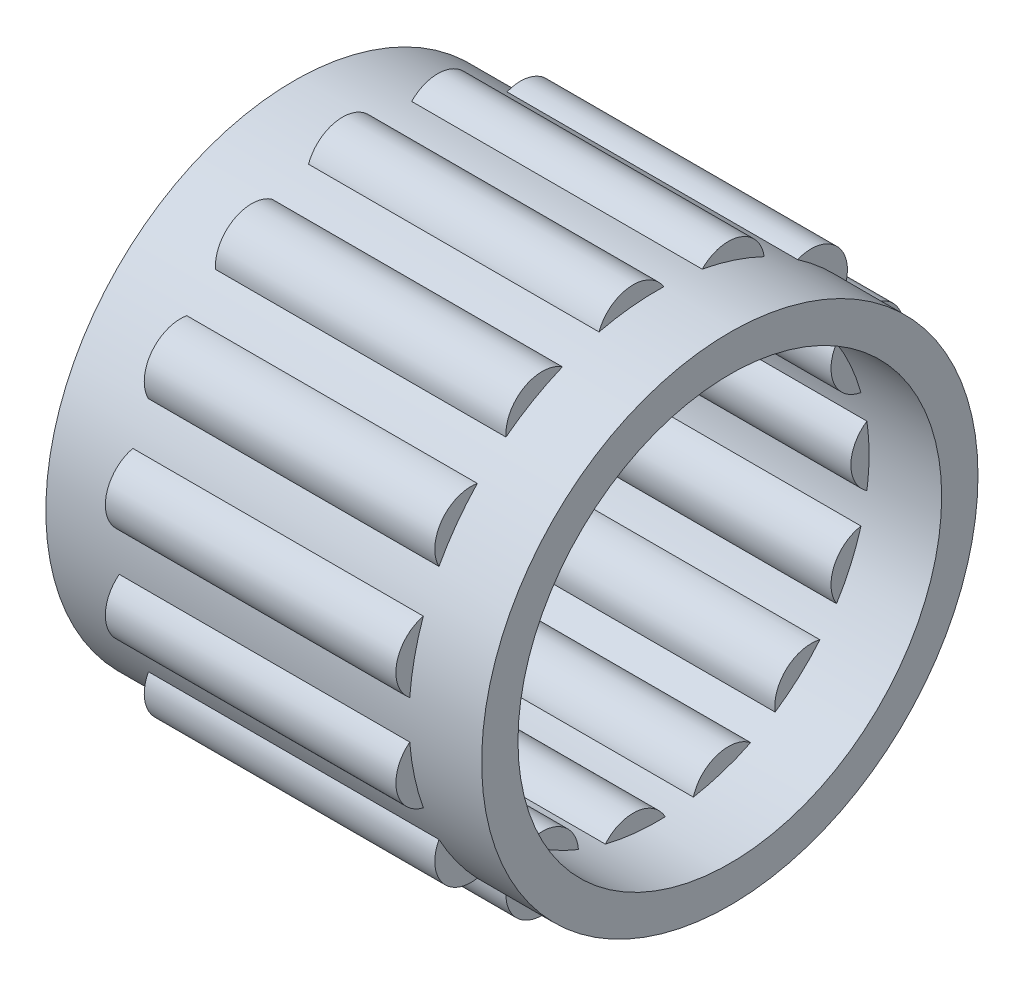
ISO-10303-21;
HEADER;
FILE_DESCRIPTION(('STEP AP214'),'2;1');
FILE_NAME('part.step','',(''),(''),'','','');
FILE_SCHEMA(('AUTOMOTIVE_DESIGN { 1 0 10303 214 1 1 1 1 }'));
ENDSEC;
DATA;
#1=APPLICATION_CONTEXT('core data for automotive mechanical design processes');
#2=APPLICATION_PROTOCOL_DEFINITION('international standard','automotive_design',2000,#1);
#3=PRODUCT_CONTEXT('',#1,'mechanical');
#4=PRODUCT('Part','Part','',(#3));
#5=PRODUCT_RELATED_PRODUCT_CATEGORY('part','',(#4));
#6=PRODUCT_DEFINITION_FORMATION('','',#4);
#7=PRODUCT_DEFINITION_CONTEXT('part definition',#1,'design');
#8=PRODUCT_DEFINITION('design','',#6,#7);
#9=PRODUCT_DEFINITION_SHAPE('','',#8);
#10=(LENGTH_UNIT() NAMED_UNIT(*) SI_UNIT(.MILLI.,.METRE.));
#11=(NAMED_UNIT(*) PLANE_ANGLE_UNIT() SI_UNIT($,.RADIAN.));
#12=(NAMED_UNIT(*) SI_UNIT($,.STERADIAN.) SOLID_ANGLE_UNIT());
#13=UNCERTAINTY_MEASURE_WITH_UNIT(LENGTH_MEASURE(1.E-05),#10,'distance_accuracy_value','');
#14=(GEOMETRIC_REPRESENTATION_CONTEXT(3) GLOBAL_UNCERTAINTY_ASSIGNED_CONTEXT((#13)) GLOBAL_UNIT_ASSIGNED_CONTEXT((#10,
#11,#12)) REPRESENTATION_CONTEXT('',''));
#15=CARTESIAN_POINT('',(0.,0.,0.));
#16=DIRECTION('',(0.,0.,1.));
#17=DIRECTION('',(1.,0.,0.));
#18=AXIS2_PLACEMENT_3D('',#15,#16,#17);
#19=CARTESIAN_POINT('',(-3.,0.,0.));
#20=DIRECTION('',(1.,0.,0.));
#21=DIRECTION('',(0.,0.,-1.));
#22=AXIS2_PLACEMENT_3D('',#19,#20,#21);
#23=PLANE('',#22);
#24=CARTESIAN_POINT('',(-3.,0.,0.));
#25=DIRECTION('',(1.,0.,0.));
#26=DIRECTION('',(0.,0.,-1.));
#27=AXIS2_PLACEMENT_3D('',#24,#25,#26);
#28=CIRCLE('',#27,4.375);
#29=CARTESIAN_POINT('',(-3.,-1.508562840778,4.10668517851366));
#30=VERTEX_POINT('',#29);
#31=CARTESIAN_POINT('',(-3.,-0.292198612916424,4.3652313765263));
#32=VERTEX_POINT('',#31);
#33=EDGE_CURVE('E408',#30,#32,#28,.F.);
#34=ORIENTED_EDGE('',*,*,#33,.T.);
#35=CARTESIAN_POINT('',(-3.,-0.9875805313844,4.646201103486));
#36=DIRECTION('',(1.,0.,0.));
#37=DIRECTION('',(0.,0.,-1.));
#38=AXIS2_PLACEMENT_3D('',#35,#36,#37);
#39=CIRCLE('',#38,0.75);
#40=EDGE_CURVE('E406',#30,#32,#39,.T.);
#41=ORIENTED_EDGE('',*,*,#40,.F.);
#42=EDGE_LOOP('',(#34,#41));
#43=FACE_BOUND('',#42,.T.);
#44=ADVANCED_FACE('F16',(#43),#23,.F.);
#45=CARTESIAN_POINT('',(3.,0.,0.));
#46=DIRECTION('',(1.,0.,0.));
#47=DIRECTION('',(0.,0.,-1.));
#48=AXIS2_PLACEMENT_3D('',#45,#46,#47);
#49=PLANE('',#48);
#50=CARTESIAN_POINT('',(3.,-0.9875805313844,4.646201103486));
#51=DIRECTION('',(1.,0.,0.));
#52=DIRECTION('',(0.,0.,-1.));
#53=AXIS2_PLACEMENT_3D('',#50,#51,#52);
#54=CIRCLE('',#53,0.75);
#55=CARTESIAN_POINT('',(3.,-0.292198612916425,4.3652313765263));
#56=VERTEX_POINT('',#55);
#57=CARTESIAN_POINT('',(3.,-1.508562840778,4.10668517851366));
#58=VERTEX_POINT('',#57);
#59=EDGE_CURVE('E20',#56,#58,#54,.F.);
#60=ORIENTED_EDGE('',*,*,#59,.F.);
#61=CARTESIAN_POINT('',(3.,0.,0.));
#62=DIRECTION('',(1.,0.,0.));
#63=DIRECTION('',(0.,0.,-1.));
#64=AXIS2_PLACEMENT_3D('',#61,#62,#63);
#65=CIRCLE('',#64,4.375);
#66=EDGE_CURVE('E393',#56,#58,#65,.T.);
#67=ORIENTED_EDGE('',*,*,#66,.T.);
#68=EDGE_LOOP('',(#60,#67));
#69=FACE_BOUND('',#68,.T.);
#70=ADVANCED_FACE('F394',(#69),#49,.T.);
#71=CARTESIAN_POINT('',(-3.,-0.9875805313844,4.646201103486));
#72=DIRECTION('',(1.,0.,0.));
#73=DIRECTION('',(0.,0.,-1.));
#74=AXIS2_PLACEMENT_3D('',#71,#72,#73);
#75=CYLINDRICAL_SURFACE('',#74,0.75);
#76=ORIENTED_EDGE('',*,*,#40,.T.);
#77=DIRECTION('',(1.,0.,0.));
#78=VECTOR('',#77,1.);
#79=CARTESIAN_POINT('',(-4.5,-0.292198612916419,4.3652313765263));
#80=LINE('',#79,#78);
#81=EDGE_CURVE('E399',#32,#56,#80,.T.);
#82=ORIENTED_EDGE('',*,*,#81,.T.);
#83=ORIENTED_EDGE('',*,*,#59,.T.);
#84=DIRECTION('',(1.,0.,0.));
#85=VECTOR('',#84,1.);
#86=CARTESIAN_POINT('',(-4.5,-1.50856284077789,4.1066851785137));
#87=LINE('',#86,#85);
#88=EDGE_CURVE('E398',#58,#30,#87,.F.);
#89=ORIENTED_EDGE('',*,*,#88,.T.);
#90=EDGE_LOOP('',(#76,#82,#83,#89));
#91=FACE_BOUND('',#90,.T.);
#92=ADVANCED_FACE('F404',(#91),#75,.T.);
#93=CARTESIAN_POINT('',(-3.,0.,0.));
#94=DIRECTION('',(1.,0.,0.));
#95=DIRECTION('',(0.,0.,-1.));
#96=AXIS2_PLACEMENT_3D('',#93,#94,#95);
#97=PLANE('',#96);
#98=CARTESIAN_POINT('',(-3.,0.,0.));
#99=DIRECTION('',(1.,0.,0.));
#100=DIRECTION('',(0.,0.,-1.));
#101=AXIS2_PLACEMENT_3D('',#98,#99,#100);
#102=CIRCLE('',#101,4.375);
#103=CARTESIAN_POINT('',(-3.,-3.04848007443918,3.13805580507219));
#104=VERTEX_POINT('',#103);
#105=CARTESIAN_POINT('',(-3.,-2.04243627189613,3.86898941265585));
#106=VERTEX_POINT('',#105);
#107=EDGE_CURVE('E409',#104,#106,#102,.F.);
#108=ORIENTED_EDGE('',*,*,#107,.T.);
#109=CARTESIAN_POINT('',(-3.,-2.791979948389,3.842830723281));
#110=DIRECTION('',(1.,0.,0.));
#111=DIRECTION('',(0.,0.,-1.));
#112=AXIS2_PLACEMENT_3D('',#109,#110,#111);
#113=CIRCLE('',#112,0.75);
#114=EDGE_CURVE('E765',#104,#106,#113,.T.);
#115=ORIENTED_EDGE('',*,*,#114,.F.);
#116=EDGE_LOOP('',(#108,#115));
#117=FACE_BOUND('',#116,.T.);
#118=ADVANCED_FACE('F905',(#117),#97,.F.);
#119=CARTESIAN_POINT('',(3.,0.,0.));
#120=DIRECTION('',(1.,0.,0.));
#121=DIRECTION('',(0.,0.,-1.));
#122=AXIS2_PLACEMENT_3D('',#119,#120,#121);
#123=PLANE('',#122);
#124=CARTESIAN_POINT('',(3.,-2.791979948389,3.842830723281));
#125=DIRECTION('',(1.,0.,0.));
#126=DIRECTION('',(0.,0.,-1.));
#127=AXIS2_PLACEMENT_3D('',#124,#125,#126);
#128=CIRCLE('',#127,0.75);
#129=CARTESIAN_POINT('',(3.,-2.04243627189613,3.86898941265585));
#130=VERTEX_POINT('',#129);
#131=CARTESIAN_POINT('',(3.,-3.04848007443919,3.13805580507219));
#132=VERTEX_POINT('',#131);
#133=EDGE_CURVE('E768',#130,#132,#128,.F.);
#134=ORIENTED_EDGE('',*,*,#133,.F.);
#135=CARTESIAN_POINT('',(3.,0.,0.));
#136=DIRECTION('',(1.,0.,0.));
#137=DIRECTION('',(0.,0.,-1.));
#138=AXIS2_PLACEMENT_3D('',#135,#136,#137);
#139=CIRCLE('',#138,4.375);
#140=EDGE_CURVE('E653',#130,#132,#139,.T.);
#141=ORIENTED_EDGE('',*,*,#140,.T.);
#142=EDGE_LOOP('',(#134,#141));
#143=FACE_BOUND('',#142,.T.);
#144=ADVANCED_FACE('F907',(#143),#123,.T.);
#145=CARTESIAN_POINT('',(-3.,-2.791979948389,3.842830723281));
#146=DIRECTION('',(1.,0.,0.));
#147=DIRECTION('',(0.,0.,-1.));
#148=AXIS2_PLACEMENT_3D('',#145,#146,#147);
#149=CYLINDRICAL_SURFACE('',#148,0.75);
#150=ORIENTED_EDGE('',*,*,#114,.T.);
#151=DIRECTION('',(1.,0.,0.));
#152=VECTOR('',#151,1.);
#153=CARTESIAN_POINT('',(-4.5,-2.04243627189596,3.86898941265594));
#154=LINE('',#153,#152);
#155=EDGE_CURVE('E411',#106,#130,#154,.T.);
#156=ORIENTED_EDGE('',*,*,#155,.T.);
#157=ORIENTED_EDGE('',*,*,#133,.T.);
#158=DIRECTION('',(1.,0.,0.));
#159=VECTOR('',#158,1.);
#160=CARTESIAN_POINT('',(-4.5,-3.04848007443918,3.13805580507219));
#161=LINE('',#160,#159);
#162=EDGE_CURVE('E652',#132,#104,#161,.F.);
#163=ORIENTED_EDGE('',*,*,#162,.T.);
#164=EDGE_LOOP('',(#150,#156,#157,#163));
#165=FACE_BOUND('',#164,.T.);
#166=ADVANCED_FACE('F900',(#165),#149,.T.);
#167=CARTESIAN_POINT('',(-3.,0.,0.));
#168=DIRECTION('',(1.,0.,0.));
#169=DIRECTION('',(0.,0.,-1.));
#170=AXIS2_PLACEMENT_3D('',#167,#168,#169);
#171=PLANE('',#170);
#172=CARTESIAN_POINT('',(-3.,0.,0.));
#173=DIRECTION('',(1.,0.,0.));
#174=DIRECTION('',(0.,0.,-1.));
#175=AXIS2_PLACEMENT_3D('',#172,#173,#174);
#176=CIRCLE('',#175,4.375);
#177=CARTESIAN_POINT('',(-3.,-4.06128740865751,1.62682807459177));
#178=VERTEX_POINT('',#177);
#179=CARTESIAN_POINT('',(-3.,-3.43951814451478,2.70376403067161));
#180=VERTEX_POINT('',#179);
#181=EDGE_CURVE('E650',#178,#180,#176,.F.);
#182=ORIENTED_EDGE('',*,*,#181,.T.);
#183=CARTESIAN_POINT('',(-3.,-4.113620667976,2.375));
#184=DIRECTION('',(1.,0.,0.));
#185=DIRECTION('',(0.,0.,-1.));
#186=AXIS2_PLACEMENT_3D('',#183,#184,#185);
#187=CIRCLE('',#186,0.75);
#188=EDGE_CURVE('E759',#178,#180,#187,.T.);
#189=ORIENTED_EDGE('',*,*,#188,.F.);
#190=EDGE_LOOP('',(#182,#189));
#191=FACE_BOUND('',#190,.T.);
#192=ADVANCED_FACE('F919',(#191),#171,.F.);
#193=CARTESIAN_POINT('',(3.,0.,0.));
#194=DIRECTION('',(1.,0.,0.));
#195=DIRECTION('',(0.,0.,-1.));
#196=AXIS2_PLACEMENT_3D('',#193,#194,#195);
#197=PLANE('',#196);
#198=CARTESIAN_POINT('',(3.,-4.113620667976,2.375));
#199=DIRECTION('',(1.,0.,0.));
#200=DIRECTION('',(0.,0.,-1.));
#201=AXIS2_PLACEMENT_3D('',#198,#199,#200);
#202=CIRCLE('',#201,0.75);
#203=CARTESIAN_POINT('',(3.,-3.43951814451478,2.70376403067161));
#204=VERTEX_POINT('',#203);
#205=CARTESIAN_POINT('',(3.,-4.06128740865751,1.62682807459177));
#206=VERTEX_POINT('',#205);
#207=EDGE_CURVE('E762',#204,#206,#202,.F.);
#208=ORIENTED_EDGE('',*,*,#207,.F.);
#209=CARTESIAN_POINT('',(3.,0.,0.));
#210=DIRECTION('',(1.,0.,0.));
#211=DIRECTION('',(0.,0.,-1.));
#212=AXIS2_PLACEMENT_3D('',#209,#210,#211);
#213=CIRCLE('',#212,4.375);
#214=EDGE_CURVE('E647',#204,#206,#213,.T.);
#215=ORIENTED_EDGE('',*,*,#214,.T.);
#216=EDGE_LOOP('',(#208,#215));
#217=FACE_BOUND('',#216,.T.);
#218=ADVANCED_FACE('F922',(#217),#197,.T.);
#219=CARTESIAN_POINT('',(-3.,-4.113620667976,2.375));
#220=DIRECTION('',(1.,0.,0.));
#221=DIRECTION('',(0.,0.,-1.));
#222=AXIS2_PLACEMENT_3D('',#219,#220,#221);
#223=CYLINDRICAL_SURFACE('',#222,0.75);
#224=ORIENTED_EDGE('',*,*,#188,.T.);
#225=DIRECTION('',(1.,0.,0.));
#226=VECTOR('',#225,1.);
#227=CARTESIAN_POINT('',(-4.5,-3.43951814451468,2.70376403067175));
#228=LINE('',#227,#226);
#229=EDGE_CURVE('E649',#180,#204,#228,.T.);
#230=ORIENTED_EDGE('',*,*,#229,.T.);
#231=ORIENTED_EDGE('',*,*,#207,.T.);
#232=DIRECTION('',(1.,0.,0.));
#233=VECTOR('',#232,1.);
#234=CARTESIAN_POINT('',(-4.5,-4.0612874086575,1.6268280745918));
#235=LINE('',#234,#233);
#236=EDGE_CURVE('E646',#206,#178,#235,.F.);
#237=ORIENTED_EDGE('',*,*,#236,.T.);
#238=EDGE_LOOP('',(#224,#230,#231,#237));
#239=FACE_BOUND('',#238,.T.);
#240=ADVANCED_FACE('F926',(#239),#223,.T.);
#241=CARTESIAN_POINT('',(-3.,0.,0.));
#242=DIRECTION('',(1.,0.,0.));
#243=DIRECTION('',(0.,0.,-1.));
#244=AXIS2_PLACEMENT_3D('',#241,#242,#243);
#245=PLANE('',#244);
#246=CARTESIAN_POINT('',(-3.,0.,0.));
#247=DIRECTION('',(1.,0.,0.));
#248=DIRECTION('',(0.,0.,-1.));
#249=AXIS2_PLACEMENT_3D('',#246,#247,#248);
#250=CIRCLE('',#249,4.375);
#251=CARTESIAN_POINT('',(-3.,-4.37186125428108,-0.165693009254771));
#252=VERTEX_POINT('',#251);
#253=CARTESIAN_POINT('',(-3.,-4.24187608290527,1.07103328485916));
#254=VERTEX_POINT('',#253);
#255=EDGE_CURVE('E644',#252,#254,#250,.F.);
#256=ORIENTED_EDGE('',*,*,#255,.T.);
#257=CARTESIAN_POINT('',(-3.,-4.723979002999,0.4965102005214));
#258=DIRECTION('',(1.,0.,0.));
#259=DIRECTION('',(0.,0.,-1.));
#260=AXIS2_PLACEMENT_3D('',#257,#258,#259);
#261=CIRCLE('',#260,0.75);
#262=EDGE_CURVE('E753',#252,#254,#261,.T.);
#263=ORIENTED_EDGE('',*,*,#262,.F.);
#264=EDGE_LOOP('',(#256,#263));
#265=FACE_BOUND('',#264,.T.);
#266=ADVANCED_FACE('F930',(#265),#245,.F.);
#267=CARTESIAN_POINT('',(3.,0.,0.));
#268=DIRECTION('',(1.,0.,0.));
#269=DIRECTION('',(0.,0.,-1.));
#270=AXIS2_PLACEMENT_3D('',#267,#268,#269);
#271=PLANE('',#270);
#272=CARTESIAN_POINT('',(3.,-4.723979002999,0.4965102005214));
#273=DIRECTION('',(1.,0.,0.));
#274=DIRECTION('',(0.,0.,-1.));
#275=AXIS2_PLACEMENT_3D('',#272,#273,#274);
#276=CIRCLE('',#275,0.75);
#277=CARTESIAN_POINT('',(3.,-4.24187608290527,1.07103328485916));
#278=VERTEX_POINT('',#277);
#279=CARTESIAN_POINT('',(3.,-4.37186125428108,-0.16569300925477));
#280=VERTEX_POINT('',#279);
#281=EDGE_CURVE('E756',#278,#280,#276,.F.);
#282=ORIENTED_EDGE('',*,*,#281,.F.);
#283=CARTESIAN_POINT('',(3.,0.,0.));
#284=DIRECTION('',(1.,0.,0.));
#285=DIRECTION('',(0.,0.,-1.));
#286=AXIS2_PLACEMENT_3D('',#283,#284,#285);
#287=CIRCLE('',#286,4.375);
#288=EDGE_CURVE('E641',#278,#280,#287,.T.);
#289=ORIENTED_EDGE('',*,*,#288,.T.);
#290=EDGE_LOOP('',(#282,#289));
#291=FACE_BOUND('',#290,.T.);
#292=ADVANCED_FACE('F934',(#291),#271,.T.);
#293=CARTESIAN_POINT('',(-3.,-4.723979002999,0.4965102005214));
#294=DIRECTION('',(1.,0.,0.));
#295=DIRECTION('',(0.,0.,-1.));
#296=AXIS2_PLACEMENT_3D('',#293,#294,#295);
#297=CYLINDRICAL_SURFACE('',#296,0.75);
#298=ORIENTED_EDGE('',*,*,#262,.T.);
#299=DIRECTION('',(1.,0.,0.));
#300=VECTOR('',#299,1.);
#301=CARTESIAN_POINT('',(-4.5,-4.2418760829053,1.07103328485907));
#302=LINE('',#301,#300);
#303=EDGE_CURVE('E643',#254,#278,#302,.T.);
#304=ORIENTED_EDGE('',*,*,#303,.T.);
#305=ORIENTED_EDGE('',*,*,#281,.T.);
#306=DIRECTION('',(1.,0.,0.));
#307=VECTOR('',#306,1.);
#308=CARTESIAN_POINT('',(-4.5,-4.37186125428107,-0.165693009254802));
#309=LINE('',#308,#307);
#310=EDGE_CURVE('E640',#280,#252,#309,.F.);
#311=ORIENTED_EDGE('',*,*,#310,.T.);
#312=EDGE_LOOP('',(#298,#304,#305,#311));
#313=FACE_BOUND('',#312,.T.);
#314=ADVANCED_FACE('F938',(#313),#297,.T.);
#315=CARTESIAN_POINT('',(-3.,0.,0.));
#316=DIRECTION('',(1.,0.,0.));
#317=DIRECTION('',(0.,0.,-1.));
#318=AXIS2_PLACEMENT_3D('',#315,#316,#317);
#319=PLANE('',#318);
#320=CARTESIAN_POINT('',(-3.,0.,0.));
#321=DIRECTION('',(1.,0.,0.));
#322=DIRECTION('',(0.,0.,-1.));
#323=AXIS2_PLACEMENT_3D('',#320,#321,#322);
#324=CIRCLE('',#323,4.375);
#325=CARTESIAN_POINT('',(-3.,-3.92650057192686,-1.92956426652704));
#326=VERTEX_POINT('',#325);
#327=CARTESIAN_POINT('',(-3.,-4.31077511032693,-0.746888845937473));
#328=VERTEX_POINT('',#327);
#329=EDGE_CURVE('E638',#326,#328,#324,.F.);
#330=ORIENTED_EDGE('',*,*,#329,.T.);
#331=CARTESIAN_POINT('',(-3.,-4.517518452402,-1.467830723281));
#332=DIRECTION('',(1.,0.,0.));
#333=DIRECTION('',(0.,0.,-1.));
#334=AXIS2_PLACEMENT_3D('',#331,#332,#333);
#335=CIRCLE('',#334,0.75);
#336=EDGE_CURVE('E747',#326,#328,#335,.T.);
#337=ORIENTED_EDGE('',*,*,#336,.F.);
#338=EDGE_LOOP('',(#330,#337));
#339=FACE_BOUND('',#338,.T.);
#340=ADVANCED_FACE('F942',(#339),#319,.F.);
#341=CARTESIAN_POINT('',(3.,0.,0.));
#342=DIRECTION('',(1.,0.,0.));
#343=DIRECTION('',(0.,0.,-1.));
#344=AXIS2_PLACEMENT_3D('',#341,#342,#343);
#345=PLANE('',#344);
#346=CARTESIAN_POINT('',(3.,-4.517518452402,-1.467830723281));
#347=DIRECTION('',(1.,0.,0.));
#348=DIRECTION('',(0.,0.,-1.));
#349=AXIS2_PLACEMENT_3D('',#346,#347,#348);
#350=CIRCLE('',#349,0.75);
#351=CARTESIAN_POINT('',(3.,-4.31077511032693,-0.746888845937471));
#352=VERTEX_POINT('',#351);
#353=CARTESIAN_POINT('',(3.,-3.92650057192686,-1.92956426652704));
#354=VERTEX_POINT('',#353);
#355=EDGE_CURVE('E750',#352,#354,#350,.F.);
#356=ORIENTED_EDGE('',*,*,#355,.F.);
#357=CARTESIAN_POINT('',(3.,0.,0.));
#358=DIRECTION('',(1.,0.,0.));
#359=DIRECTION('',(0.,0.,-1.));
#360=AXIS2_PLACEMENT_3D('',#357,#358,#359);
#361=CIRCLE('',#360,4.375);
#362=EDGE_CURVE('E635',#352,#354,#361,.T.);
#363=ORIENTED_EDGE('',*,*,#362,.T.);
#364=EDGE_LOOP('',(#356,#363));
#365=FACE_BOUND('',#364,.T.);
#366=ADVANCED_FACE('F946',(#365),#345,.T.);
#367=CARTESIAN_POINT('',(-3.,-4.517518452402,-1.467830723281));
#368=DIRECTION('',(1.,0.,0.));
#369=DIRECTION('',(0.,0.,-1.));
#370=AXIS2_PLACEMENT_3D('',#367,#368,#369);
#371=CYLINDRICAL_SURFACE('',#370,0.75);
#372=ORIENTED_EDGE('',*,*,#336,.T.);
#373=DIRECTION('',(1.,0.,0.));
#374=VECTOR('',#373,1.);
#375=CARTESIAN_POINT('',(-4.5,-4.31077511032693,-0.746888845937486));
#376=LINE('',#375,#374);
#377=EDGE_CURVE('E637',#328,#352,#376,.T.);
#378=ORIENTED_EDGE('',*,*,#377,.T.);
#379=ORIENTED_EDGE('',*,*,#355,.T.);
#380=DIRECTION('',(1.,0.,0.));
#381=VECTOR('',#380,1.);
#382=CARTESIAN_POINT('',(-4.5,-3.9265005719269,-1.92956426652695));
#383=LINE('',#382,#381);
#384=EDGE_CURVE('E634',#354,#326,#383,.F.);
#385=ORIENTED_EDGE('',*,*,#384,.T.);
#386=EDGE_LOOP('',(#372,#378,#379,#385));
#387=FACE_BOUND('',#386,.T.);
#388=ADVANCED_FACE('F950',(#387),#371,.T.);
#389=CARTESIAN_POINT('',(-3.,0.,0.));
#390=DIRECTION('',(1.,0.,0.));
#391=DIRECTION('',(0.,0.,-1.));
#392=AXIS2_PLACEMENT_3D('',#389,#390,#391);
#393=PLANE('',#392);
#394=CARTESIAN_POINT('',(-3.,0.,0.));
#395=DIRECTION('',(1.,0.,0.));
#396=DIRECTION('',(0.,0.,-1.));
#397=AXIS2_PLACEMENT_3D('',#394,#395,#396);
#398=CIRCLE('',#397,4.375);
#399=CARTESIAN_POINT('',(-3.,-2.80221226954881,-3.35979633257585));
#400=VERTEX_POINT('',#399);
#401=CARTESIAN_POINT('',(-3.,-3.6343019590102,-2.43566710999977));
#402=VERTEX_POINT('',#401);
#403=EDGE_CURVE('E632',#400,#402,#398,.F.);
#404=ORIENTED_EDGE('',*,*,#403,.T.);
#405=CARTESIAN_POINT('',(-3.,-3.529937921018,-3.178370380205));
#406=DIRECTION('',(1.,0.,0.));
#407=DIRECTION('',(0.,0.,-1.));
#408=AXIS2_PLACEMENT_3D('',#405,#406,#407);
#409=CIRCLE('',#408,0.75);
#410=EDGE_CURVE('E741',#400,#402,#409,.T.);
#411=ORIENTED_EDGE('',*,*,#410,.F.);
#412=EDGE_LOOP('',(#404,#411));
#413=FACE_BOUND('',#412,.T.);
#414=ADVANCED_FACE('F954',(#413),#393,.F.);
#415=CARTESIAN_POINT('',(3.,0.,0.));
#416=DIRECTION('',(1.,0.,0.));
#417=DIRECTION('',(0.,0.,-1.));
#418=AXIS2_PLACEMENT_3D('',#415,#416,#417);
#419=PLANE('',#418);
#420=CARTESIAN_POINT('',(3.,-3.529937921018,-3.178370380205));
#421=DIRECTION('',(1.,0.,0.));
#422=DIRECTION('',(0.,0.,-1.));
#423=AXIS2_PLACEMENT_3D('',#420,#421,#422);
#424=CIRCLE('',#423,0.75);
#425=CARTESIAN_POINT('',(3.,-3.6343019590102,-2.43566710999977));
#426=VERTEX_POINT('',#425);
#427=CARTESIAN_POINT('',(3.,-2.80221226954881,-3.35979633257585));
#428=VERTEX_POINT('',#427);
#429=EDGE_CURVE('E744',#426,#428,#424,.F.);
#430=ORIENTED_EDGE('',*,*,#429,.F.);
#431=CARTESIAN_POINT('',(3.,0.,0.));
#432=DIRECTION('',(1.,0.,0.));
#433=DIRECTION('',(0.,0.,-1.));
#434=AXIS2_PLACEMENT_3D('',#431,#432,#433);
#435=CIRCLE('',#434,4.375);
#436=EDGE_CURVE('E629',#426,#428,#435,.T.);
#437=ORIENTED_EDGE('',*,*,#436,.T.);
#438=EDGE_LOOP('',(#430,#437));
#439=FACE_BOUND('',#438,.T.);
#440=ADVANCED_FACE('F958',(#439),#419,.T.);
#441=CARTESIAN_POINT('',(-3.,-3.529937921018,-3.178370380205));
#442=DIRECTION('',(1.,0.,0.));
#443=DIRECTION('',(0.,0.,-1.));
#444=AXIS2_PLACEMENT_3D('',#441,#442,#443);
#445=CYLINDRICAL_SURFACE('',#444,0.75);
#446=ORIENTED_EDGE('',*,*,#410,.T.);
#447=DIRECTION('',(1.,0.,0.));
#448=VECTOR('',#447,1.);
#449=CARTESIAN_POINT('',(-4.5,-3.63430195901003,-2.43566711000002));
#450=LINE('',#449,#448);
#451=EDGE_CURVE('E631',#402,#426,#450,.T.);
#452=ORIENTED_EDGE('',*,*,#451,.T.);
#453=ORIENTED_EDGE('',*,*,#429,.T.);
#454=DIRECTION('',(1.,0.,0.));
#455=VECTOR('',#454,1.);
#456=CARTESIAN_POINT('',(-4.5,-2.80221226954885,-3.35979633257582));
#457=LINE('',#456,#455);
#458=EDGE_CURVE('E628',#428,#400,#457,.F.);
#459=ORIENTED_EDGE('',*,*,#458,.T.);
#460=EDGE_LOOP('',(#446,#452,#453,#459));
#461=FACE_BOUND('',#460,.T.);
#462=ADVANCED_FACE('F962',(#461),#445,.T.);
#463=CARTESIAN_POINT('',(-3.,0.,0.));
#464=DIRECTION('',(1.,0.,0.));
#465=DIRECTION('',(0.,0.,-1.));
#466=AXIS2_PLACEMENT_3D('',#463,#464,#465);
#467=PLANE('',#466);
#468=CARTESIAN_POINT('',(-3.,0.,0.));
#469=DIRECTION('',(1.,0.,0.));
#470=DIRECTION('',(0.,0.,-1.));
#471=AXIS2_PLACEMENT_3D('',#468,#469,#470);
#472=CIRCLE('',#471,4.375);
#473=CARTESIAN_POINT('',(-3.,-1.19339600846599,-4.20908908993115));
#474=VERTEX_POINT('',#473);
#475=CARTESIAN_POINT('',(-3.,-2.32942498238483,-3.70329640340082));
#476=VERTEX_POINT('',#475);
#477=EDGE_CURVE('E626',#474,#476,#472,.F.);
#478=ORIENTED_EDGE('',*,*,#477,.T.);
#479=CARTESIAN_POINT('',(-3.,-1.93199905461,-4.339340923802));
#480=DIRECTION('',(1.,0.,0.));
#481=DIRECTION('',(0.,0.,-1.));
#482=AXIS2_PLACEMENT_3D('',#479,#480,#481);
#483=CIRCLE('',#482,0.75);
#484=EDGE_CURVE('E735',#474,#476,#483,.T.);
#485=ORIENTED_EDGE('',*,*,#484,.F.);
#486=EDGE_LOOP('',(#478,#485));
#487=FACE_BOUND('',#486,.T.);
#488=ADVANCED_FACE('F966',(#487),#467,.F.);
#489=CARTESIAN_POINT('',(3.,0.,0.));
#490=DIRECTION('',(1.,0.,0.));
#491=DIRECTION('',(0.,0.,-1.));
#492=AXIS2_PLACEMENT_3D('',#489,#490,#491);
#493=PLANE('',#492);
#494=CARTESIAN_POINT('',(3.,-1.93199905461,-4.339340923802));
#495=DIRECTION('',(1.,0.,0.));
#496=DIRECTION('',(0.,0.,-1.));
#497=AXIS2_PLACEMENT_3D('',#494,#495,#496);
#498=CIRCLE('',#497,0.75);
#499=CARTESIAN_POINT('',(3.,-2.32942498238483,-3.70329640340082));
#500=VERTEX_POINT('',#499);
#501=CARTESIAN_POINT('',(3.,-1.19339600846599,-4.20908908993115));
#502=VERTEX_POINT('',#501);
#503=EDGE_CURVE('E738',#500,#502,#498,.F.);
#504=ORIENTED_EDGE('',*,*,#503,.F.);
#505=CARTESIAN_POINT('',(3.,0.,0.));
#506=DIRECTION('',(1.,0.,0.));
#507=DIRECTION('',(0.,0.,-1.));
#508=AXIS2_PLACEMENT_3D('',#505,#506,#507);
#509=CIRCLE('',#508,4.375);
#510=EDGE_CURVE('E623',#500,#502,#509,.T.);
#511=ORIENTED_EDGE('',*,*,#510,.T.);
#512=EDGE_LOOP('',(#504,#511));
#513=FACE_BOUND('',#512,.T.);
#514=ADVANCED_FACE('F970',(#513),#493,.T.);
#515=CARTESIAN_POINT('',(-3.,-1.93199905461,-4.339340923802));
#516=DIRECTION('',(1.,0.,0.));
#517=DIRECTION('',(0.,0.,-1.));
#518=AXIS2_PLACEMENT_3D('',#515,#516,#517);
#519=CYLINDRICAL_SURFACE('',#518,0.75);
#520=ORIENTED_EDGE('',*,*,#484,.T.);
#521=DIRECTION('',(1.,0.,0.));
#522=VECTOR('',#521,1.);
#523=CARTESIAN_POINT('',(-4.5,-2.32942498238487,-3.70329640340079));
#524=LINE('',#523,#522);
#525=EDGE_CURVE('E625',#476,#500,#524,.T.);
#526=ORIENTED_EDGE('',*,*,#525,.T.);
#527=ORIENTED_EDGE('',*,*,#503,.T.);
#528=DIRECTION('',(1.,0.,0.));
#529=VECTOR('',#528,1.);
#530=CARTESIAN_POINT('',(-4.5,-1.19339600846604,-4.20908908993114));
#531=LINE('',#530,#529);
#532=EDGE_CURVE('E622',#502,#474,#531,.F.);
#533=ORIENTED_EDGE('',*,*,#532,.T.);
#534=EDGE_LOOP('',(#520,#526,#527,#533));
#535=FACE_BOUND('',#534,.T.);
#536=ADVANCED_FACE('F974',(#535),#519,.T.);
#537=CARTESIAN_POINT('',(-3.,0.,0.));
#538=DIRECTION('',(1.,0.,0.));
#539=DIRECTION('',(0.,0.,-1.));
#540=AXIS2_PLACEMENT_3D('',#537,#538,#539);
#541=PLANE('',#540);
#542=CARTESIAN_POINT('',(-3.,0.,0.));
#543=DIRECTION('',(1.,0.,0.));
#544=DIRECTION('',(0.,0.,-1.));
#545=AXIS2_PLACEMENT_3D('',#542,#543,#544);
#546=CIRCLE('',#545,4.375);
#547=CARTESIAN_POINT('',(-3.,0.621769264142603,-4.33059210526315));
#548=VERTEX_POINT('',#547);
#549=CARTESIAN_POINT('',(-3.,-0.6217692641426,-4.33059210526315));
#550=VERTEX_POINT('',#549);
#551=EDGE_CURVE('E620',#548,#550,#546,.F.);
#552=ORIENTED_EDGE('',*,*,#551,.T.);
#553=CARTESIAN_POINT('',(-3.,0.,-4.75));
#554=DIRECTION('',(1.,0.,0.));
#555=DIRECTION('',(0.,0.,-1.));
#556=AXIS2_PLACEMENT_3D('',#553,#554,#555);
#557=CIRCLE('',#556,0.75);
#558=EDGE_CURVE('E729',#548,#550,#557,.T.);
#559=ORIENTED_EDGE('',*,*,#558,.F.);
#560=EDGE_LOOP('',(#552,#559));
#561=FACE_BOUND('',#560,.T.);
#562=ADVANCED_FACE('F978',(#561),#541,.F.);
#563=CARTESIAN_POINT('',(3.,0.,0.));
#564=DIRECTION('',(1.,0.,0.));
#565=DIRECTION('',(0.,0.,-1.));
#566=AXIS2_PLACEMENT_3D('',#563,#564,#565);
#567=PLANE('',#566);
#568=CARTESIAN_POINT('',(3.,0.,-4.75));
#569=DIRECTION('',(1.,0.,0.));
#570=DIRECTION('',(0.,0.,-1.));
#571=AXIS2_PLACEMENT_3D('',#568,#569,#570);
#572=CIRCLE('',#571,0.75);
#573=CARTESIAN_POINT('',(3.,-0.621769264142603,-4.33059210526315));
#574=VERTEX_POINT('',#573);
#575=CARTESIAN_POINT('',(3.,0.6217692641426,-4.33059210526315));
#576=VERTEX_POINT('',#575);
#577=EDGE_CURVE('E732',#574,#576,#572,.F.);
#578=ORIENTED_EDGE('',*,*,#577,.F.);
#579=CARTESIAN_POINT('',(3.,0.,0.));
#580=DIRECTION('',(1.,0.,0.));
#581=DIRECTION('',(0.,0.,-1.));
#582=AXIS2_PLACEMENT_3D('',#579,#580,#581);
#583=CIRCLE('',#582,4.375);
#584=EDGE_CURVE('E618',#574,#576,#583,.T.);
#585=ORIENTED_EDGE('',*,*,#584,.T.);
#586=EDGE_LOOP('',(#578,#585));
#587=FACE_BOUND('',#586,.T.);
#588=ADVANCED_FACE('F982',(#587),#567,.T.);
#589=CARTESIAN_POINT('',(-3.,0.,-4.75));
#590=DIRECTION('',(1.,0.,0.));
#591=DIRECTION('',(0.,0.,-1.));
#592=AXIS2_PLACEMENT_3D('',#589,#590,#591);
#593=CYLINDRICAL_SURFACE('',#592,0.75);
#594=ORIENTED_EDGE('',*,*,#558,.T.);
#595=DIRECTION('',(1.,0.,0.));
#596=VECTOR('',#595,1.);
#597=CARTESIAN_POINT('',(-4.5,-0.621769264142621,-4.33059210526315));
#598=LINE('',#597,#596);
#599=EDGE_CURVE('E416',#550,#574,#598,.T.);
#600=ORIENTED_EDGE('',*,*,#599,.T.);
#601=ORIENTED_EDGE('',*,*,#577,.T.);
#602=DIRECTION('',(1.,0.,0.));
#603=VECTOR('',#602,1.);
#604=CARTESIAN_POINT('',(-4.5,0.621769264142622,-4.33059210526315));
#605=LINE('',#604,#603);
#606=EDGE_CURVE('E617',#576,#548,#605,.F.);
#607=ORIENTED_EDGE('',*,*,#606,.T.);
#608=EDGE_LOOP('',(#594,#600,#601,#607));
#609=FACE_BOUND('',#608,.T.);
#610=ADVANCED_FACE('F986',(#609),#593,.T.);
#611=CARTESIAN_POINT('',(-3.,0.,0.));
#612=DIRECTION('',(1.,0.,0.));
#613=DIRECTION('',(0.,0.,-1.));
#614=AXIS2_PLACEMENT_3D('',#611,#612,#613);
#615=PLANE('',#614);
#616=CARTESIAN_POINT('',(-3.,0.,0.));
#617=DIRECTION('',(1.,0.,0.));
#618=DIRECTION('',(0.,0.,-1.));
#619=AXIS2_PLACEMENT_3D('',#616,#617,#618);
#620=CIRCLE('',#619,4.375);
#621=CARTESIAN_POINT('',(-3.,2.32942498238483,-3.70329640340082));
#622=VERTEX_POINT('',#621);
#623=CARTESIAN_POINT('',(-3.,1.19339600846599,-4.20908908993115));
#624=VERTEX_POINT('',#623);
#625=EDGE_CURVE('E615',#622,#624,#620,.F.);
#626=ORIENTED_EDGE('',*,*,#625,.T.);
#627=CARTESIAN_POINT('',(-3.,1.93199905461,-4.339340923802));
#628=DIRECTION('',(1.,0.,0.));
#629=DIRECTION('',(0.,0.,-1.));
#630=AXIS2_PLACEMENT_3D('',#627,#628,#629);
#631=CIRCLE('',#630,0.75);
#632=EDGE_CURVE('E723',#622,#624,#631,.T.);
#633=ORIENTED_EDGE('',*,*,#632,.F.);
#634=EDGE_LOOP('',(#626,#633));
#635=FACE_BOUND('',#634,.T.);
#636=ADVANCED_FACE('F990',(#635),#615,.F.);
#637=CARTESIAN_POINT('',(3.,0.,0.));
#638=DIRECTION('',(1.,0.,0.));
#639=DIRECTION('',(0.,0.,-1.));
#640=AXIS2_PLACEMENT_3D('',#637,#638,#639);
#641=PLANE('',#640);
#642=CARTESIAN_POINT('',(3.,1.93199905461,-4.339340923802));
#643=DIRECTION('',(1.,0.,0.));
#644=DIRECTION('',(0.,0.,-1.));
#645=AXIS2_PLACEMENT_3D('',#642,#643,#644);
#646=CIRCLE('',#645,0.75);
#647=CARTESIAN_POINT('',(3.,1.19339600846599,-4.20908908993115));
#648=VERTEX_POINT('',#647);
#649=CARTESIAN_POINT('',(3.,2.32942498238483,-3.70329640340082));
#650=VERTEX_POINT('',#649);
#651=EDGE_CURVE('E726',#648,#650,#646,.F.);
#652=ORIENTED_EDGE('',*,*,#651,.F.);
#653=CARTESIAN_POINT('',(3.,0.,0.));
#654=DIRECTION('',(1.,0.,0.));
#655=DIRECTION('',(0.,0.,-1.));
#656=AXIS2_PLACEMENT_3D('',#653,#654,#655);
#657=CIRCLE('',#656,4.375);
#658=EDGE_CURVE('E612',#648,#650,#657,.T.);
#659=ORIENTED_EDGE('',*,*,#658,.T.);
#660=EDGE_LOOP('',(#652,#659));
#661=FACE_BOUND('',#660,.T.);
#662=ADVANCED_FACE('F994',(#661),#641,.T.);
#663=CARTESIAN_POINT('',(-3.,1.93199905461,-4.339340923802));
#664=DIRECTION('',(1.,0.,0.));
#665=DIRECTION('',(0.,0.,-1.));
#666=AXIS2_PLACEMENT_3D('',#663,#664,#665);
#667=CYLINDRICAL_SURFACE('',#666,0.75);
#668=ORIENTED_EDGE('',*,*,#632,.T.);
#669=DIRECTION('',(1.,0.,0.));
#670=VECTOR('',#669,1.);
#671=CARTESIAN_POINT('',(-4.5,1.19339600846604,-4.20908908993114));
#672=LINE('',#671,#670);
#673=EDGE_CURVE('E614',#624,#648,#672,.T.);
#674=ORIENTED_EDGE('',*,*,#673,.T.);
#675=ORIENTED_EDGE('',*,*,#651,.T.);
#676=DIRECTION('',(1.,0.,0.));
#677=VECTOR('',#676,1.);
#678=CARTESIAN_POINT('',(-4.5,2.32942498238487,-3.70329640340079));
#679=LINE('',#678,#677);
#680=EDGE_CURVE('E611',#650,#622,#679,.F.);
#681=ORIENTED_EDGE('',*,*,#680,.T.);
#682=EDGE_LOOP('',(#668,#674,#675,#681));
#683=FACE_BOUND('',#682,.T.);
#684=ADVANCED_FACE('F998',(#683),#667,.T.);
#685=CARTESIAN_POINT('',(-3.,0.,0.));
#686=DIRECTION('',(1.,0.,0.));
#687=DIRECTION('',(0.,0.,-1.));
#688=AXIS2_PLACEMENT_3D('',#685,#686,#687);
#689=PLANE('',#688);
#690=CARTESIAN_POINT('',(-3.,0.,0.));
#691=DIRECTION('',(1.,0.,0.));
#692=DIRECTION('',(0.,0.,-1.));
#693=AXIS2_PLACEMENT_3D('',#690,#691,#692);
#694=CIRCLE('',#693,4.375);
#695=CARTESIAN_POINT('',(-3.,3.6343019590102,-2.43566710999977));
#696=VERTEX_POINT('',#695);
#697=CARTESIAN_POINT('',(-3.,2.80221226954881,-3.35979633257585));
#698=VERTEX_POINT('',#697);
#699=EDGE_CURVE('E609',#696,#698,#694,.F.);
#700=ORIENTED_EDGE('',*,*,#699,.T.);
#701=CARTESIAN_POINT('',(-3.,3.529937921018,-3.178370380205));
#702=DIRECTION('',(1.,0.,0.));
#703=DIRECTION('',(0.,0.,-1.));
#704=AXIS2_PLACEMENT_3D('',#701,#702,#703);
#705=CIRCLE('',#704,0.75);
#706=EDGE_CURVE('E717',#696,#698,#705,.T.);
#707=ORIENTED_EDGE('',*,*,#706,.F.);
#708=EDGE_LOOP('',(#700,#707));
#709=FACE_BOUND('',#708,.T.);
#710=ADVANCED_FACE('F1002',(#709),#689,.F.);
#711=CARTESIAN_POINT('',(3.,0.,0.));
#712=DIRECTION('',(1.,0.,0.));
#713=DIRECTION('',(0.,0.,-1.));
#714=AXIS2_PLACEMENT_3D('',#711,#712,#713);
#715=PLANE('',#714);
#716=CARTESIAN_POINT('',(3.,3.529937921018,-3.178370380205));
#717=DIRECTION('',(1.,0.,0.));
#718=DIRECTION('',(0.,0.,-1.));
#719=AXIS2_PLACEMENT_3D('',#716,#717,#718);
#720=CIRCLE('',#719,0.75);
#721=CARTESIAN_POINT('',(3.,2.80221226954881,-3.35979633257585));
#722=VERTEX_POINT('',#721);
#723=CARTESIAN_POINT('',(3.,3.6343019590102,-2.43566710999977));
#724=VERTEX_POINT('',#723);
#725=EDGE_CURVE('E720',#722,#724,#720,.F.);
#726=ORIENTED_EDGE('',*,*,#725,.F.);
#727=CARTESIAN_POINT('',(3.,0.,0.));
#728=DIRECTION('',(1.,0.,0.));
#729=DIRECTION('',(0.,0.,-1.));
#730=AXIS2_PLACEMENT_3D('',#727,#728,#729);
#731=CIRCLE('',#730,4.375);
#732=EDGE_CURVE('E606',#722,#724,#731,.T.);
#733=ORIENTED_EDGE('',*,*,#732,.T.);
#734=EDGE_LOOP('',(#726,#733));
#735=FACE_BOUND('',#734,.T.);
#736=ADVANCED_FACE('F1006',(#735),#715,.T.);
#737=CARTESIAN_POINT('',(-3.,3.529937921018,-3.178370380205));
#738=DIRECTION('',(1.,0.,0.));
#739=DIRECTION('',(0.,0.,-1.));
#740=AXIS2_PLACEMENT_3D('',#737,#738,#739);
#741=CYLINDRICAL_SURFACE('',#740,0.75);
#742=ORIENTED_EDGE('',*,*,#706,.T.);
#743=DIRECTION('',(1.,0.,0.));
#744=VECTOR('',#743,1.);
#745=CARTESIAN_POINT('',(-4.5,2.80221226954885,-3.35979633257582));
#746=LINE('',#745,#744);
#747=EDGE_CURVE('E608',#698,#722,#746,.T.);
#748=ORIENTED_EDGE('',*,*,#747,.T.);
#749=ORIENTED_EDGE('',*,*,#725,.T.);
#750=DIRECTION('',(1.,0.,0.));
#751=VECTOR('',#750,1.);
#752=CARTESIAN_POINT('',(-4.5,3.63430195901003,-2.43566711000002));
#753=LINE('',#752,#751);
#754=EDGE_CURVE('E605',#724,#696,#753,.F.);
#755=ORIENTED_EDGE('',*,*,#754,.T.);
#756=EDGE_LOOP('',(#742,#748,#749,#755));
#757=FACE_BOUND('',#756,.T.);
#758=ADVANCED_FACE('F1010',(#757),#741,.T.);
#759=CARTESIAN_POINT('',(-3.,0.,0.));
#760=DIRECTION('',(1.,0.,0.));
#761=DIRECTION('',(0.,0.,-1.));
#762=AXIS2_PLACEMENT_3D('',#759,#760,#761);
#763=PLANE('',#762);
#764=CARTESIAN_POINT('',(-3.,0.,0.));
#765=DIRECTION('',(1.,0.,0.));
#766=DIRECTION('',(0.,0.,-1.));
#767=AXIS2_PLACEMENT_3D('',#764,#765,#766);
#768=CIRCLE('',#767,4.375);
#769=CARTESIAN_POINT('',(-3.,4.31077511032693,-0.746888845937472));
#770=VERTEX_POINT('',#769);
#771=CARTESIAN_POINT('',(-3.,3.92650057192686,-1.92956426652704));
#772=VERTEX_POINT('',#771);
#773=EDGE_CURVE('E603',#770,#772,#768,.F.);
#774=ORIENTED_EDGE('',*,*,#773,.T.);
#775=CARTESIAN_POINT('',(-3.,4.517518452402,-1.467830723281));
#776=DIRECTION('',(1.,0.,0.));
#777=DIRECTION('',(0.,0.,-1.));
#778=AXIS2_PLACEMENT_3D('',#775,#776,#777);
#779=CIRCLE('',#778,0.75);
#780=EDGE_CURVE('E711',#770,#772,#779,.T.);
#781=ORIENTED_EDGE('',*,*,#780,.F.);
#782=EDGE_LOOP('',(#774,#781));
#783=FACE_BOUND('',#782,.T.);
#784=ADVANCED_FACE('F1014',(#783),#763,.F.);
#785=CARTESIAN_POINT('',(3.,0.,0.));
#786=DIRECTION('',(1.,0.,0.));
#787=DIRECTION('',(0.,0.,-1.));
#788=AXIS2_PLACEMENT_3D('',#785,#786,#787);
#789=PLANE('',#788);
#790=CARTESIAN_POINT('',(3.,4.517518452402,-1.467830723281));
#791=DIRECTION('',(1.,0.,0.));
#792=DIRECTION('',(0.,0.,-1.));
#793=AXIS2_PLACEMENT_3D('',#790,#791,#792);
#794=CIRCLE('',#793,0.75);
#795=CARTESIAN_POINT('',(3.,3.92650057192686,-1.92956426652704));
#796=VERTEX_POINT('',#795);
#797=CARTESIAN_POINT('',(3.,4.31077511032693,-0.746888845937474));
#798=VERTEX_POINT('',#797);
#799=EDGE_CURVE('E714',#796,#798,#794,.F.);
#800=ORIENTED_EDGE('',*,*,#799,.F.);
#801=CARTESIAN_POINT('',(3.,0.,0.));
#802=DIRECTION('',(1.,0.,0.));
#803=DIRECTION('',(0.,0.,-1.));
#804=AXIS2_PLACEMENT_3D('',#801,#802,#803);
#805=CIRCLE('',#804,4.375);
#806=EDGE_CURVE('E600',#796,#798,#805,.T.);
#807=ORIENTED_EDGE('',*,*,#806,.T.);
#808=EDGE_LOOP('',(#800,#807));
#809=FACE_BOUND('',#808,.T.);
#810=ADVANCED_FACE('F1018',(#809),#789,.T.);
#811=CARTESIAN_POINT('',(-3.,4.517518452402,-1.467830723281));
#812=DIRECTION('',(1.,0.,0.));
#813=DIRECTION('',(0.,0.,-1.));
#814=AXIS2_PLACEMENT_3D('',#811,#812,#813);
#815=CYLINDRICAL_SURFACE('',#814,0.75);
#816=ORIENTED_EDGE('',*,*,#780,.T.);
#817=DIRECTION('',(1.,0.,0.));
#818=VECTOR('',#817,1.);
#819=CARTESIAN_POINT('',(-4.5,3.9265005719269,-1.92956426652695));
#820=LINE('',#819,#818);
#821=EDGE_CURVE('E602',#772,#796,#820,.T.);
#822=ORIENTED_EDGE('',*,*,#821,.T.);
#823=ORIENTED_EDGE('',*,*,#799,.T.);
#824=DIRECTION('',(1.,0.,0.));
#825=VECTOR('',#824,1.);
#826=CARTESIAN_POINT('',(-4.5,4.31077511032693,-0.746888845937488));
#827=LINE('',#826,#825);
#828=EDGE_CURVE('E599',#798,#770,#827,.F.);
#829=ORIENTED_EDGE('',*,*,#828,.T.);
#830=EDGE_LOOP('',(#816,#822,#823,#829));
#831=FACE_BOUND('',#830,.T.);
#832=ADVANCED_FACE('F1022',(#831),#815,.T.);
#833=CARTESIAN_POINT('',(-3.,0.,0.));
#834=DIRECTION('',(1.,0.,0.));
#835=DIRECTION('',(0.,0.,-1.));
#836=AXIS2_PLACEMENT_3D('',#833,#834,#835);
#837=PLANE('',#836);
#838=CARTESIAN_POINT('',(-3.,0.,0.));
#839=DIRECTION('',(1.,0.,0.));
#840=DIRECTION('',(0.,0.,-1.));
#841=AXIS2_PLACEMENT_3D('',#838,#839,#840);
#842=CIRCLE('',#841,4.375);
#843=CARTESIAN_POINT('',(-3.,4.24187608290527,1.07103328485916));
#844=VERTEX_POINT('',#843);
#845=CARTESIAN_POINT('',(-3.,4.37186125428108,-0.16569300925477));
#846=VERTEX_POINT('',#845);
#847=EDGE_CURVE('E597',#844,#846,#842,.F.);
#848=ORIENTED_EDGE('',*,*,#847,.T.);
#849=CARTESIAN_POINT('',(-3.,4.723979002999,0.4965102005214));
#850=DIRECTION('',(1.,0.,0.));
#851=DIRECTION('',(0.,0.,-1.));
#852=AXIS2_PLACEMENT_3D('',#849,#850,#851);
#853=CIRCLE('',#852,0.75);
#854=EDGE_CURVE('E705',#844,#846,#853,.T.);
#855=ORIENTED_EDGE('',*,*,#854,.F.);
#856=EDGE_LOOP('',(#848,#855));
#857=FACE_BOUND('',#856,.T.);
#858=ADVANCED_FACE('F1026',(#857),#837,.F.);
#859=CARTESIAN_POINT('',(3.,0.,0.));
#860=DIRECTION('',(1.,0.,0.));
#861=DIRECTION('',(0.,0.,-1.));
#862=AXIS2_PLACEMENT_3D('',#859,#860,#861);
#863=PLANE('',#862);
#864=CARTESIAN_POINT('',(3.,4.723979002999,0.4965102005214));
#865=DIRECTION('',(1.,0.,0.));
#866=DIRECTION('',(0.,0.,-1.));
#867=AXIS2_PLACEMENT_3D('',#864,#865,#866);
#868=CIRCLE('',#867,0.75);
#869=CARTESIAN_POINT('',(3.,4.37186125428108,-0.165693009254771));
#870=VERTEX_POINT('',#869);
#871=CARTESIAN_POINT('',(3.,4.24187608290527,1.07103328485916));
#872=VERTEX_POINT('',#871);
#873=EDGE_CURVE('E708',#870,#872,#868,.F.);
#874=ORIENTED_EDGE('',*,*,#873,.F.);
#875=CARTESIAN_POINT('',(3.,0.,0.));
#876=DIRECTION('',(1.,0.,0.));
#877=DIRECTION('',(0.,0.,-1.));
#878=AXIS2_PLACEMENT_3D('',#875,#876,#877);
#879=CIRCLE('',#878,4.375);
#880=EDGE_CURVE('E594',#870,#872,#879,.T.);
#881=ORIENTED_EDGE('',*,*,#880,.T.);
#882=EDGE_LOOP('',(#874,#881));
#883=FACE_BOUND('',#882,.T.);
#884=ADVANCED_FACE('F1030',(#883),#863,.T.);
#885=CARTESIAN_POINT('',(-3.,4.723979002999,0.4965102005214));
#886=DIRECTION('',(1.,0.,0.));
#887=DIRECTION('',(0.,0.,-1.));
#888=AXIS2_PLACEMENT_3D('',#885,#886,#887);
#889=CYLINDRICAL_SURFACE('',#888,0.75);
#890=ORIENTED_EDGE('',*,*,#854,.T.);
#891=DIRECTION('',(1.,0.,0.));
#892=VECTOR('',#891,1.);
#893=CARTESIAN_POINT('',(-4.5,4.37186125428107,-0.165693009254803));
#894=LINE('',#893,#892);
#895=EDGE_CURVE('E596',#846,#870,#894,.T.);
#896=ORIENTED_EDGE('',*,*,#895,.T.);
#897=ORIENTED_EDGE('',*,*,#873,.T.);
#898=DIRECTION('',(1.,0.,0.));
#899=VECTOR('',#898,1.);
#900=CARTESIAN_POINT('',(-4.5,4.2418760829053,1.07103328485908));
#901=LINE('',#900,#899);
#902=EDGE_CURVE('E593',#872,#844,#901,.F.);
#903=ORIENTED_EDGE('',*,*,#902,.T.);
#904=EDGE_LOOP('',(#890,#896,#897,#903));
#905=FACE_BOUND('',#904,.T.);
#906=ADVANCED_FACE('F1034',(#905),#889,.T.);
#907=CARTESIAN_POINT('',(-3.,0.,0.));
#908=DIRECTION('',(1.,0.,0.));
#909=DIRECTION('',(0.,0.,-1.));
#910=AXIS2_PLACEMENT_3D('',#907,#908,#909);
#911=PLANE('',#910);
#912=CARTESIAN_POINT('',(-3.,0.,0.));
#913=DIRECTION('',(1.,0.,0.));
#914=DIRECTION('',(0.,0.,-1.));
#915=AXIS2_PLACEMENT_3D('',#912,#913,#914);
#916=CIRCLE('',#915,4.375);
#917=CARTESIAN_POINT('',(-3.,3.43951814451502,2.7037640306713));
#918=VERTEX_POINT('',#917);
#919=CARTESIAN_POINT('',(-3.,4.06128740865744,1.62682807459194));
#920=VERTEX_POINT('',#919);
#921=EDGE_CURVE('E591',#918,#920,#916,.F.);
#922=ORIENTED_EDGE('',*,*,#921,.T.);
#923=CARTESIAN_POINT('',(-3.,4.113620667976,2.375));
#924=DIRECTION('',(1.,0.,0.));
#925=DIRECTION('',(0.,0.,-1.));
#926=AXIS2_PLACEMENT_3D('',#923,#924,#925);
#927=CIRCLE('',#926,0.75);
#928=EDGE_CURVE('E699',#918,#920,#927,.T.);
#929=ORIENTED_EDGE('',*,*,#928,.F.);
#930=EDGE_LOOP('',(#922,#929));
#931=FACE_BOUND('',#930,.T.);
#932=ADVANCED_FACE('F1038',(#931),#911,.F.);
#933=CARTESIAN_POINT('',(3.,0.,0.));
#934=DIRECTION('',(1.,0.,0.));
#935=DIRECTION('',(0.,0.,-1.));
#936=AXIS2_PLACEMENT_3D('',#933,#934,#935);
#937=PLANE('',#936);
#938=CARTESIAN_POINT('',(3.,4.113620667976,2.375));
#939=DIRECTION('',(1.,0.,0.));
#940=DIRECTION('',(0.,0.,-1.));
#941=AXIS2_PLACEMENT_3D('',#938,#939,#940);
#942=CIRCLE('',#941,0.75);
#943=CARTESIAN_POINT('',(3.,4.06128740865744,1.62682807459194));
#944=VERTEX_POINT('',#943);
#945=CARTESIAN_POINT('',(3.,3.43951814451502,2.7037640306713));
#946=VERTEX_POINT('',#945);
#947=EDGE_CURVE('E702',#944,#946,#942,.F.);
#948=ORIENTED_EDGE('',*,*,#947,.F.);
#949=CARTESIAN_POINT('',(3.,0.,0.));
#950=DIRECTION('',(1.,0.,0.));
#951=DIRECTION('',(0.,0.,-1.));
#952=AXIS2_PLACEMENT_3D('',#949,#950,#951);
#953=CIRCLE('',#952,4.375);
#954=EDGE_CURVE('E588',#944,#946,#953,.T.);
#955=ORIENTED_EDGE('',*,*,#954,.T.);
#956=EDGE_LOOP('',(#948,#955));
#957=FACE_BOUND('',#956,.T.);
#958=ADVANCED_FACE('F1042',(#957),#937,.T.);
#959=CARTESIAN_POINT('',(-3.,4.113620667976,2.375));
#960=DIRECTION('',(1.,0.,0.));
#961=DIRECTION('',(0.,0.,-1.));
#962=AXIS2_PLACEMENT_3D('',#959,#960,#961);
#963=CYLINDRICAL_SURFACE('',#962,0.75);
#964=ORIENTED_EDGE('',*,*,#928,.T.);
#965=DIRECTION('',(1.,0.,0.));
#966=VECTOR('',#965,1.);
#967=CARTESIAN_POINT('',(-4.5,4.06128740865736,1.62682807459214));
#968=LINE('',#967,#966);
#969=EDGE_CURVE('E590',#920,#944,#968,.T.);
#970=ORIENTED_EDGE('',*,*,#969,.T.);
#971=ORIENTED_EDGE('',*,*,#947,.T.);
#972=DIRECTION('',(1.,0.,0.));
#973=VECTOR('',#972,1.);
#974=CARTESIAN_POINT('',(-4.5,3.43951814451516,2.70376403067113));
#975=LINE('',#974,#973);
#976=EDGE_CURVE('E587',#946,#918,#975,.F.);
#977=ORIENTED_EDGE('',*,*,#976,.T.);
#978=EDGE_LOOP('',(#964,#970,#971,#977));
#979=FACE_BOUND('',#978,.T.);
#980=ADVANCED_FACE('F1046',(#979),#963,.T.);
#981=CARTESIAN_POINT('',(-3.,0.,0.));
#982=DIRECTION('',(1.,0.,0.));
#983=DIRECTION('',(0.,0.,-1.));
#984=AXIS2_PLACEMENT_3D('',#981,#982,#983);
#985=PLANE('',#984);
#986=CARTESIAN_POINT('',(-3.,0.,0.));
#987=DIRECTION('',(1.,0.,0.));
#988=DIRECTION('',(0.,0.,-1.));
#989=AXIS2_PLACEMENT_3D('',#986,#987,#988);
#990=CIRCLE('',#989,4.375);
#991=CARTESIAN_POINT('',(-3.,2.04243627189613,3.86898941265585));
#992=VERTEX_POINT('',#991);
#993=CARTESIAN_POINT('',(-3.,3.04848007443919,3.13805580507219));
#994=VERTEX_POINT('',#993);
#995=EDGE_CURVE('E585',#992,#994,#990,.F.);
#996=ORIENTED_EDGE('',*,*,#995,.T.);
#997=CARTESIAN_POINT('',(-3.,2.791979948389,3.842830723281));
#998=DIRECTION('',(1.,0.,0.));
#999=DIRECTION('',(0.,0.,-1.));
#1000=AXIS2_PLACEMENT_3D('',#997,#998,#999);
#1001=CIRCLE('',#1000,0.75);
#1002=EDGE_CURVE('E693',#992,#994,#1001,.T.);
#1003=ORIENTED_EDGE('',*,*,#1002,.F.);
#1004=EDGE_LOOP('',(#996,#1003));
#1005=FACE_BOUND('',#1004,.T.);
#1006=ADVANCED_FACE('F1050',(#1005),#985,.F.);
#1007=CARTESIAN_POINT('',(3.,0.,0.));
#1008=DIRECTION('',(1.,0.,0.));
#1009=DIRECTION('',(0.,0.,-1.));
#1010=AXIS2_PLACEMENT_3D('',#1007,#1008,#1009);
#1011=PLANE('',#1010);
#1012=CARTESIAN_POINT('',(3.,2.791979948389,3.842830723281));
#1013=DIRECTION('',(1.,0.,0.));
#1014=DIRECTION('',(0.,0.,-1.));
#1015=AXIS2_PLACEMENT_3D('',#1012,#1013,#1014);
#1016=CIRCLE('',#1015,0.75);
#1017=CARTESIAN_POINT('',(3.,3.04848007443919,3.13805580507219));
#1018=VERTEX_POINT('',#1017);
#1019=CARTESIAN_POINT('',(3.,2.04243627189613,3.86898941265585));
#1020=VERTEX_POINT('',#1019);
#1021=EDGE_CURVE('E696',#1018,#1020,#1016,.F.);
#1022=ORIENTED_EDGE('',*,*,#1021,.F.);
#1023=CARTESIAN_POINT('',(3.,0.,0.));
#1024=DIRECTION('',(1.,0.,0.));
#1025=DIRECTION('',(0.,0.,-1.));
#1026=AXIS2_PLACEMENT_3D('',#1023,#1024,#1025);
#1027=CIRCLE('',#1026,4.375);
#1028=EDGE_CURVE('E582',#1018,#1020,#1027,.T.);
#1029=ORIENTED_EDGE('',*,*,#1028,.T.);
#1030=EDGE_LOOP('',(#1022,#1029));
#1031=FACE_BOUND('',#1030,.T.);
#1032=ADVANCED_FACE('F1054',(#1031),#1011,.T.);
#1033=CARTESIAN_POINT('',(-3.,2.791979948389,3.842830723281));
#1034=DIRECTION('',(1.,0.,0.));
#1035=DIRECTION('',(0.,0.,-1.));
#1036=AXIS2_PLACEMENT_3D('',#1033,#1034,#1035);
#1037=CYLINDRICAL_SURFACE('',#1036,0.75);
#1038=ORIENTED_EDGE('',*,*,#1002,.T.);
#1039=DIRECTION('',(1.,0.,0.));
#1040=VECTOR('',#1039,1.);
#1041=CARTESIAN_POINT('',(-4.5,3.04848007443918,3.13805580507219));
#1042=LINE('',#1041,#1040);
#1043=EDGE_CURVE('E584',#994,#1018,#1042,.T.);
#1044=ORIENTED_EDGE('',*,*,#1043,.T.);
#1045=ORIENTED_EDGE('',*,*,#1021,.T.);
#1046=DIRECTION('',(1.,0.,0.));
#1047=VECTOR('',#1046,1.);
#1048=CARTESIAN_POINT('',(-4.5,2.04243627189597,3.86898941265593));
#1049=LINE('',#1048,#1047);
#1050=EDGE_CURVE('E581',#1020,#992,#1049,.F.);
#1051=ORIENTED_EDGE('',*,*,#1050,.T.);
#1052=EDGE_LOOP('',(#1038,#1044,#1045,#1051));
#1053=FACE_BOUND('',#1052,.T.);
#1054=ADVANCED_FACE('F1058',(#1053),#1037,.T.);
#1055=CARTESIAN_POINT('',(-3.,0.,0.));
#1056=DIRECTION('',(1.,0.,0.));
#1057=DIRECTION('',(0.,0.,-1.));
#1058=AXIS2_PLACEMENT_3D('',#1055,#1056,#1057);
#1059=PLANE('',#1058);
#1060=CARTESIAN_POINT('',(-3.,0.,0.));
#1061=DIRECTION('',(1.,0.,0.));
#1062=DIRECTION('',(0.,0.,-1.));
#1063=AXIS2_PLACEMENT_3D('',#1060,#1061,#1062);
#1064=CIRCLE('',#1063,4.375);
#1065=CARTESIAN_POINT('',(-3.,0.292198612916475,4.3652313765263));
#1066=VERTEX_POINT('',#1065);
#1067=CARTESIAN_POINT('',(-3.,1.508562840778,4.10668517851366));
#1068=VERTEX_POINT('',#1067);
#1069=EDGE_CURVE('E579',#1066,#1068,#1064,.F.);
#1070=ORIENTED_EDGE('',*,*,#1069,.T.);
#1071=CARTESIAN_POINT('',(-3.,0.9875805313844,4.646201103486));
#1072=DIRECTION('',(1.,0.,0.));
#1073=DIRECTION('',(0.,0.,-1.));
#1074=AXIS2_PLACEMENT_3D('',#1071,#1072,#1073);
#1075=CIRCLE('',#1074,0.75);
#1076=EDGE_CURVE('E687',#1066,#1068,#1075,.T.);
#1077=ORIENTED_EDGE('',*,*,#1076,.F.);
#1078=EDGE_LOOP('',(#1070,#1077));
#1079=FACE_BOUND('',#1078,.T.);
#1080=ADVANCED_FACE('F1062',(#1079),#1059,.F.);
#1081=CARTESIAN_POINT('',(3.,0.,0.));
#1082=DIRECTION('',(1.,0.,0.));
#1083=DIRECTION('',(0.,0.,-1.));
#1084=AXIS2_PLACEMENT_3D('',#1081,#1082,#1083);
#1085=PLANE('',#1084);
#1086=CARTESIAN_POINT('',(3.,0.9875805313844,4.646201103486));
#1087=DIRECTION('',(1.,0.,0.));
#1088=DIRECTION('',(0.,0.,-1.));
#1089=AXIS2_PLACEMENT_3D('',#1086,#1087,#1088);
#1090=CIRCLE('',#1089,0.75);
#1091=CARTESIAN_POINT('',(3.,1.508562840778,4.10668517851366));
#1092=VERTEX_POINT('',#1091);
#1093=CARTESIAN_POINT('',(3.,0.292198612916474,4.3652313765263));
#1094=VERTEX_POINT('',#1093);
#1095=EDGE_CURVE('E690',#1092,#1094,#1090,.F.);
#1096=ORIENTED_EDGE('',*,*,#1095,.F.);
#1097=CARTESIAN_POINT('',(3.,0.,0.));
#1098=DIRECTION('',(1.,0.,0.));
#1099=DIRECTION('',(0.,0.,-1.));
#1100=AXIS2_PLACEMENT_3D('',#1097,#1098,#1099);
#1101=CIRCLE('',#1100,4.375);
#1102=EDGE_CURVE('E576',#1092,#1094,#1101,.T.);
#1103=ORIENTED_EDGE('',*,*,#1102,.T.);
#1104=EDGE_LOOP('',(#1096,#1103));
#1105=FACE_BOUND('',#1104,.T.);
#1106=ADVANCED_FACE('F1066',(#1105),#1085,.T.);
#1107=CARTESIAN_POINT('',(-3.,0.9875805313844,4.646201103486));
#1108=DIRECTION('',(1.,0.,0.));
#1109=DIRECTION('',(0.,0.,-1.));
#1110=AXIS2_PLACEMENT_3D('',#1107,#1108,#1109);
#1111=CYLINDRICAL_SURFACE('',#1110,0.75);
#1112=ORIENTED_EDGE('',*,*,#1076,.T.);
#1113=DIRECTION('',(1.,0.,0.));
#1114=VECTOR('',#1113,1.);
#1115=CARTESIAN_POINT('',(-4.5,1.50856284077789,4.1066851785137));
#1116=LINE('',#1115,#1114);
#1117=EDGE_CURVE('E578',#1068,#1092,#1116,.T.);
#1118=ORIENTED_EDGE('',*,*,#1117,.T.);
#1119=ORIENTED_EDGE('',*,*,#1095,.T.);
#1120=DIRECTION('',(1.,0.,0.));
#1121=VECTOR('',#1120,1.);
#1122=CARTESIAN_POINT('',(-4.5,0.292198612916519,4.3652313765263));
#1123=LINE('',#1122,#1121);
#1124=EDGE_CURVE('E575',#1094,#1066,#1123,.F.);
#1125=ORIENTED_EDGE('',*,*,#1124,.T.);
#1126=EDGE_LOOP('',(#1112,#1118,#1119,#1125));
#1127=FACE_BOUND('',#1126,.T.);
#1128=ADVANCED_FACE('F1070',(#1127),#1111,.T.);
#1129=CARTESIAN_POINT('',(3.,0.,0.));
#1130=DIRECTION('',(1.,0.,0.));
#1131=DIRECTION('',(0.,0.,-1.));
#1132=AXIS2_PLACEMENT_3D('',#1129,#1130,#1131);
#1133=PLANE('',#1132);
#1134=CARTESIAN_POINT('',(3.,0.,-4.75));
#1135=DIRECTION('',(1.,0.,0.));
#1136=DIRECTION('',(0.,0.,-1.));
#1137=AXIS2_PLACEMENT_3D('',#1134,#1135,#1136);
#1138=CIRCLE('',#1137,0.75);
#1139=CARTESIAN_POINT('',(3.,0.673207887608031,-5.08059210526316));
#1140=VERTEX_POINT('',#1139);
#1141=CARTESIAN_POINT('',(3.,-0.673207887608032,-5.08059210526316));
#1142=VERTEX_POINT('',#1141);
#1143=EDGE_CURVE('E572',#1140,#1142,#1138,.F.);
#1144=ORIENTED_EDGE('',*,*,#1143,.F.);
#1145=CARTESIAN_POINT('',(3.,0.,0.));
#1146=DIRECTION('',(1.,0.,0.));
#1147=DIRECTION('',(0.,0.,-1.));
#1148=AXIS2_PLACEMENT_3D('',#1145,#1146,#1147);
#1149=CIRCLE('',#1148,5.125);
#1150=EDGE_CURVE('E685',#1140,#1142,#1149,.F.);
#1151=ORIENTED_EDGE('',*,*,#1150,.T.);
#1152=EDGE_LOOP('',(#1144,#1151));
#1153=FACE_BOUND('',#1152,.T.);
#1154=ADVANCED_FACE('F1074',(#1153),#1133,.T.);
#1155=CARTESIAN_POINT('',(-3.,0.,0.));
#1156=DIRECTION('',(1.,0.,0.));
#1157=DIRECTION('',(0.,0.,-1.));
#1158=AXIS2_PLACEMENT_3D('',#1155,#1156,#1157);
#1159=PLANE('',#1158);
#1160=CARTESIAN_POINT('',(-3.,0.,0.));
#1161=DIRECTION('',(1.,0.,0.));
#1162=DIRECTION('',(0.,0.,-1.));
#1163=AXIS2_PLACEMENT_3D('',#1160,#1161,#1162);
#1164=CIRCLE('',#1163,5.125);
#1165=CARTESIAN_POINT('',(-3.,0.673207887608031,-5.08059210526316));
#1166=VERTEX_POINT('',#1165);
#1167=CARTESIAN_POINT('',(-3.,-0.673207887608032,-5.08059210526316));
#1168=VERTEX_POINT('',#1167);
#1169=EDGE_CURVE('E683',#1166,#1168,#1164,.F.);
#1170=ORIENTED_EDGE('',*,*,#1169,.F.);
#1171=CARTESIAN_POINT('',(-3.,0.,-4.75));
#1172=DIRECTION('',(1.,0.,0.));
#1173=DIRECTION('',(0.,0.,-1.));
#1174=AXIS2_PLACEMENT_3D('',#1171,#1172,#1173);
#1175=CIRCLE('',#1174,0.75);
#1176=EDGE_CURVE('E569',#1168,#1166,#1175,.T.);
#1177=ORIENTED_EDGE('',*,*,#1176,.F.);
#1178=EDGE_LOOP('',(#1170,#1177));
#1179=FACE_BOUND('',#1178,.T.);
#1180=ADVANCED_FACE('F1078',(#1179),#1159,.F.);
#1181=CARTESIAN_POINT('',(3.,0.,0.));
#1182=DIRECTION('',(1.,0.,0.));
#1183=DIRECTION('',(0.,0.,-1.));
#1184=AXIS2_PLACEMENT_3D('',#1181,#1182,#1183);
#1185=PLANE('',#1184);
#1186=CARTESIAN_POINT('',(3.,1.93199905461,-4.339340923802));
#1187=DIRECTION('',(1.,0.,0.));
#1188=DIRECTION('',(0.,0.,-1.));
#1189=AXIS2_PLACEMENT_3D('',#1186,#1187,#1188);
#1190=CIRCLE('',#1189,0.75);
#1191=CARTESIAN_POINT('',(3.,2.68146898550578,-4.36753352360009));
#1192=VERTEX_POINT('',#1191);
#1193=CARTESIAN_POINT('',(3.,1.45145696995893,-4.91517015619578));
#1194=VERTEX_POINT('',#1193);
#1195=EDGE_CURVE('E681',#1192,#1194,#1190,.F.);
#1196=ORIENTED_EDGE('',*,*,#1195,.F.);
#1197=CARTESIAN_POINT('',(3.,0.,0.));
#1198=DIRECTION('',(1.,0.,0.));
#1199=DIRECTION('',(0.,0.,-1.));
#1200=AXIS2_PLACEMENT_3D('',#1197,#1198,#1199);
#1201=CIRCLE('',#1200,5.125);
#1202=EDGE_CURVE('E561',#1194,#1192,#1201,.T.);
#1203=ORIENTED_EDGE('',*,*,#1202,.F.);
#1204=EDGE_LOOP('',(#1196,#1203));
#1205=FACE_BOUND('',#1204,.T.);
#1206=ADVANCED_FACE('F1082',(#1205),#1185,.T.);
#1207=CARTESIAN_POINT('',(-3.,1.93199905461,-4.339340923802));
#1208=DIRECTION('',(1.,0.,0.));
#1209=DIRECTION('',(0.,0.,-1.));
#1210=AXIS2_PLACEMENT_3D('',#1207,#1208,#1209);
#1211=CYLINDRICAL_SURFACE('',#1210,0.75);
#1212=ORIENTED_EDGE('',*,*,#1195,.T.);
#1213=DIRECTION('',(1.,0.,0.));
#1214=VECTOR('',#1213,1.);
#1215=CARTESIAN_POINT('',(-4.5,1.45145696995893,-4.91517015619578));
#1216=LINE('',#1215,#1214);
#1217=CARTESIAN_POINT('',(-3.,1.45145696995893,-4.91517015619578));
#1218=VERTEX_POINT('',#1217);
#1219=EDGE_CURVE('E564',#1218,#1194,#1216,.T.);
#1220=ORIENTED_EDGE('',*,*,#1219,.F.);
#1221=CARTESIAN_POINT('',(-3.,1.93199905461,-4.339340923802));
#1222=DIRECTION('',(1.,0.,0.));
#1223=DIRECTION('',(0.,0.,-1.));
#1224=AXIS2_PLACEMENT_3D('',#1221,#1222,#1223);
#1225=CIRCLE('',#1224,0.75);
#1226=CARTESIAN_POINT('',(-3.,2.68146898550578,-4.36753352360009));
#1227=VERTEX_POINT('',#1226);
#1228=EDGE_CURVE('E679',#1218,#1227,#1225,.T.);
#1229=ORIENTED_EDGE('',*,*,#1228,.T.);
#1230=DIRECTION('',(1.,0.,0.));
#1231=VECTOR('',#1230,1.);
#1232=CARTESIAN_POINT('',(-4.5,2.68146898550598,-4.36753352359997));
#1233=LINE('',#1232,#1231);
#1234=EDGE_CURVE('E560',#1192,#1227,#1233,.F.);
#1235=ORIENTED_EDGE('',*,*,#1234,.F.);
#1236=EDGE_LOOP('',(#1212,#1220,#1229,#1235));
#1237=FACE_BOUND('',#1236,.T.);
#1238=ADVANCED_FACE('F1086',(#1237),#1211,.T.);
#1239=CARTESIAN_POINT('',(-3.,0.,0.));
#1240=DIRECTION('',(1.,0.,0.));
#1241=DIRECTION('',(0.,0.,-1.));
#1242=AXIS2_PLACEMENT_3D('',#1239,#1240,#1241);
#1243=PLANE('',#1242);
#1244=CARTESIAN_POINT('',(-3.,0.,0.));
#1245=DIRECTION('',(1.,0.,0.));
#1246=DIRECTION('',(0.,0.,-1.));
#1247=AXIS2_PLACEMENT_3D('',#1244,#1245,#1246);
#1248=CIRCLE('',#1247,5.125);
#1249=EDGE_CURVE('E557',#1227,#1218,#1248,.F.);
#1250=ORIENTED_EDGE('',*,*,#1249,.F.);
#1251=ORIENTED_EDGE('',*,*,#1228,.F.);
#1252=EDGE_LOOP('',(#1250,#1251));
#1253=FACE_BOUND('',#1252,.T.);
#1254=ADVANCED_FACE('F1090',(#1253),#1243,.F.);
#1255=CARTESIAN_POINT('',(3.,0.,0.));
#1256=DIRECTION('',(1.,0.,0.));
#1257=DIRECTION('',(0.,0.,-1.));
#1258=AXIS2_PLACEMENT_3D('',#1255,#1256,#1257);
#1259=PLANE('',#1258);
#1260=CARTESIAN_POINT('',(3.,3.529937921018,-3.178370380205));
#1261=DIRECTION('',(1.,0.,0.));
#1262=DIRECTION('',(0.,0.,-1.));
#1263=AXIS2_PLACEMENT_3D('',#1260,#1261,#1262);
#1264=CIRCLE('',#1263,0.75);
#1265=CARTESIAN_POINT('',(3.,4.22607973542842,-2.89928871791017));
#1266=VERTEX_POINT('',#1265);
#1267=CARTESIAN_POINT('',(3.,3.32515173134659,-3.89987063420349));
#1268=VERTEX_POINT('',#1267);
#1269=EDGE_CURVE('E677',#1266,#1268,#1264,.F.);
#1270=ORIENTED_EDGE('',*,*,#1269,.F.);
#1271=CARTESIAN_POINT('',(3.,0.,0.));
#1272=DIRECTION('',(1.,0.,0.));
#1273=DIRECTION('',(0.,0.,-1.));
#1274=AXIS2_PLACEMENT_3D('',#1271,#1272,#1273);
#1275=CIRCLE('',#1274,5.125);
#1276=EDGE_CURVE('E553',#1268,#1266,#1275,.T.);
#1277=ORIENTED_EDGE('',*,*,#1276,.F.);
#1278=EDGE_LOOP('',(#1270,#1277));
#1279=FACE_BOUND('',#1278,.T.);
#1280=ADVANCED_FACE('F1093',(#1279),#1259,.T.);
#1281=CARTESIAN_POINT('',(-3.,3.529937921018,-3.178370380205));
#1282=DIRECTION('',(1.,0.,0.));
#1283=DIRECTION('',(0.,0.,-1.));
#1284=AXIS2_PLACEMENT_3D('',#1281,#1282,#1283);
#1285=CYLINDRICAL_SURFACE('',#1284,0.75);
#1286=ORIENTED_EDGE('',*,*,#1269,.T.);
#1287=DIRECTION('',(1.,0.,0.));
#1288=VECTOR('',#1287,1.);
#1289=CARTESIAN_POINT('',(-4.5,3.32515173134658,-3.89987063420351));
#1290=LINE('',#1289,#1288);
#1291=CARTESIAN_POINT('',(-3.,3.32515173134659,-3.89987063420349));
#1292=VERTEX_POINT('',#1291);
#1293=EDGE_CURVE('E556',#1292,#1268,#1290,.T.);
#1294=ORIENTED_EDGE('',*,*,#1293,.F.);
#1295=CARTESIAN_POINT('',(-3.,3.529937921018,-3.178370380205));
#1296=DIRECTION('',(1.,0.,0.));
#1297=DIRECTION('',(0.,0.,-1.));
#1298=AXIS2_PLACEMENT_3D('',#1295,#1296,#1297);
#1299=CIRCLE('',#1298,0.75);
#1300=CARTESIAN_POINT('',(-3.,4.22607973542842,-2.89928871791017));
#1301=VERTEX_POINT('',#1300);
#1302=EDGE_CURVE('E675',#1292,#1301,#1299,.T.);
#1303=ORIENTED_EDGE('',*,*,#1302,.T.);
#1304=DIRECTION('',(1.,0.,0.));
#1305=VECTOR('',#1304,1.);
#1306=CARTESIAN_POINT('',(-4.5,4.22607973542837,-2.89928871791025));
#1307=LINE('',#1306,#1305);
#1308=EDGE_CURVE('E552',#1266,#1301,#1307,.F.);
#1309=ORIENTED_EDGE('',*,*,#1308,.F.);
#1310=EDGE_LOOP('',(#1286,#1294,#1303,#1309));
#1311=FACE_BOUND('',#1310,.T.);
#1312=ADVANCED_FACE('F1097',(#1311),#1285,.T.);
#1313=CARTESIAN_POINT('',(-3.,0.,0.));
#1314=DIRECTION('',(1.,0.,0.));
#1315=DIRECTION('',(0.,0.,-1.));
#1316=AXIS2_PLACEMENT_3D('',#1313,#1314,#1315);
#1317=PLANE('',#1316);
#1318=CARTESIAN_POINT('',(-3.,0.,0.));
#1319=DIRECTION('',(1.,0.,0.));
#1320=DIRECTION('',(0.,0.,-1.));
#1321=AXIS2_PLACEMENT_3D('',#1318,#1319,#1320);
#1322=CIRCLE('',#1321,5.125);
#1323=EDGE_CURVE('E549',#1301,#1292,#1322,.F.);
#1324=ORIENTED_EDGE('',*,*,#1323,.F.);
#1325=ORIENTED_EDGE('',*,*,#1302,.F.);
#1326=EDGE_LOOP('',(#1324,#1325));
#1327=FACE_BOUND('',#1326,.T.);
#1328=ADVANCED_FACE('F1101',(#1327),#1317,.F.);
#1329=CARTESIAN_POINT('',(3.,0.,0.));
#1330=DIRECTION('',(1.,0.,0.));
#1331=DIRECTION('',(0.,0.,-1.));
#1332=AXIS2_PLACEMENT_3D('',#1329,#1330,#1331);
#1333=PLANE('',#1332);
#1334=CARTESIAN_POINT('',(3.,4.517518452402,-1.467830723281));
#1335=DIRECTION('',(1.,0.,0.));
#1336=DIRECTION('',(0.,0.,-1.));
#1337=AXIS2_PLACEMENT_3D('',#1334,#1335,#1336);
#1338=CIRCLE('',#1337,0.75);
#1339=CARTESIAN_POINT('',(3.,5.03996290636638,-0.92973055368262));
#1340=VERTEX_POINT('',#1339);
#1341=CARTESIAN_POINT('',(3.,4.62389755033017,-2.21024805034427));
#1342=VERTEX_POINT('',#1341);
#1343=EDGE_CURVE('E673',#1340,#1342,#1338,.F.);
#1344=ORIENTED_EDGE('',*,*,#1343,.F.);
#1345=CARTESIAN_POINT('',(3.,0.,0.));
#1346=DIRECTION('',(1.,0.,0.));
#1347=DIRECTION('',(0.,0.,-1.));
#1348=AXIS2_PLACEMENT_3D('',#1345,#1346,#1347);
#1349=CIRCLE('',#1348,5.125);
#1350=EDGE_CURVE('E545',#1342,#1340,#1349,.T.);
#1351=ORIENTED_EDGE('',*,*,#1350,.F.);
#1352=EDGE_LOOP('',(#1344,#1351));
#1353=FACE_BOUND('',#1352,.T.);
#1354=ADVANCED_FACE('F1105',(#1353),#1333,.T.);
#1355=CARTESIAN_POINT('',(-3.,4.517518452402,-1.467830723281));
#1356=DIRECTION('',(1.,0.,0.));
#1357=DIRECTION('',(0.,0.,-1.));
#1358=AXIS2_PLACEMENT_3D('',#1355,#1356,#1357);
#1359=CYLINDRICAL_SURFACE('',#1358,0.75);
#1360=ORIENTED_EDGE('',*,*,#1343,.T.);
#1361=DIRECTION('',(1.,0.,0.));
#1362=VECTOR('',#1361,1.);
#1363=CARTESIAN_POINT('',(-4.5,4.62389755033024,-2.21024805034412));
#1364=LINE('',#1363,#1362);
#1365=CARTESIAN_POINT('',(-3.,4.62389755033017,-2.21024805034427));
#1366=VERTEX_POINT('',#1365);
#1367=EDGE_CURVE('E548',#1366,#1342,#1364,.T.);
#1368=ORIENTED_EDGE('',*,*,#1367,.F.);
#1369=CARTESIAN_POINT('',(-3.,4.517518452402,-1.467830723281));
#1370=DIRECTION('',(1.,0.,0.));
#1371=DIRECTION('',(0.,0.,-1.));
#1372=AXIS2_PLACEMENT_3D('',#1369,#1370,#1371);
#1373=CIRCLE('',#1372,0.75);
#1374=CARTESIAN_POINT('',(-3.,5.03996290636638,-0.92973055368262));
#1375=VERTEX_POINT('',#1374);
#1376=EDGE_CURVE('E671',#1366,#1375,#1373,.T.);
#1377=ORIENTED_EDGE('',*,*,#1376,.T.);
#1378=DIRECTION('',(1.,0.,0.));
#1379=VECTOR('',#1378,1.);
#1380=CARTESIAN_POINT('',(-4.5,5.03996290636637,-0.929730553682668));
#1381=LINE('',#1380,#1379);
#1382=EDGE_CURVE('E544',#1340,#1375,#1381,.F.);
#1383=ORIENTED_EDGE('',*,*,#1382,.F.);
#1384=EDGE_LOOP('',(#1360,#1368,#1377,#1383));
#1385=FACE_BOUND('',#1384,.T.);
#1386=ADVANCED_FACE('F1109',(#1385),#1359,.T.);
#1387=CARTESIAN_POINT('',(-3.,0.,0.));
#1388=DIRECTION('',(1.,0.,0.));
#1389=DIRECTION('',(0.,0.,-1.));
#1390=AXIS2_PLACEMENT_3D('',#1387,#1388,#1389);
#1391=PLANE('',#1390);
#1392=CARTESIAN_POINT('',(-3.,0.,0.));
#1393=DIRECTION('',(1.,0.,0.));
#1394=DIRECTION('',(0.,0.,-1.));
#1395=AXIS2_PLACEMENT_3D('',#1392,#1393,#1394);
#1396=CIRCLE('',#1395,5.125);
#1397=EDGE_CURVE('E541',#1375,#1366,#1396,.F.);
#1398=ORIENTED_EDGE('',*,*,#1397,.F.);
#1399=ORIENTED_EDGE('',*,*,#1376,.F.);
#1400=EDGE_LOOP('',(#1398,#1399));
#1401=FACE_BOUND('',#1400,.T.);
#1402=ADVANCED_FACE('F1113',(#1401),#1391,.F.);
#1403=CARTESIAN_POINT('',(3.,0.,0.));
#1404=DIRECTION('',(1.,0.,0.));
#1405=DIRECTION('',(0.,0.,-1.));
#1406=AXIS2_PLACEMENT_3D('',#1403,#1404,#1405);
#1407=PLANE('',#1406);
#1408=CARTESIAN_POINT('',(3.,4.723979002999,0.4965102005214));
#1409=DIRECTION('',(1.,0.,0.));
#1410=DIRECTION('',(0.,0.,-1.));
#1411=AXIS2_PLACEMENT_3D('',#1408,#1409,#1410);
#1412=CIRCLE('',#1411,0.75);
#1413=CARTESIAN_POINT('',(3.,4.98239070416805,1.20058646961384));
#1414=VERTEX_POINT('',#1413);
#1415=CARTESIAN_POINT('',(3.,5.12312947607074,-0.13845349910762));
#1416=VERTEX_POINT('',#1415);
#1417=EDGE_CURVE('E669',#1414,#1416,#1412,.F.);
#1418=ORIENTED_EDGE('',*,*,#1417,.F.);
#1419=CARTESIAN_POINT('',(3.,0.,0.));
#1420=DIRECTION('',(1.,0.,0.));
#1421=DIRECTION('',(0.,0.,-1.));
#1422=AXIS2_PLACEMENT_3D('',#1419,#1420,#1421);
#1423=CIRCLE('',#1422,5.125);
#1424=EDGE_CURVE('E537',#1416,#1414,#1423,.T.);
#1425=ORIENTED_EDGE('',*,*,#1424,.F.);
#1426=EDGE_LOOP('',(#1418,#1425));
#1427=FACE_BOUND('',#1426,.T.);
#1428=ADVANCED_FACE('F1117',(#1427),#1407,.T.);
#1429=CARTESIAN_POINT('',(-3.,4.723979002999,0.4965102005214));
#1430=DIRECTION('',(1.,0.,0.));
#1431=DIRECTION('',(0.,0.,-1.));
#1432=AXIS2_PLACEMENT_3D('',#1429,#1430,#1431);
#1433=CYLINDRICAL_SURFACE('',#1432,0.75);
#1434=ORIENTED_EDGE('',*,*,#1417,.T.);
#1435=DIRECTION('',(1.,0.,0.));
#1436=VECTOR('',#1435,1.);
#1437=CARTESIAN_POINT('',(-4.5,5.12312947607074,-0.138453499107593));
#1438=LINE('',#1437,#1436);
#1439=CARTESIAN_POINT('',(-3.,5.12312947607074,-0.13845349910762));
#1440=VERTEX_POINT('',#1439);
#1441=EDGE_CURVE('E540',#1440,#1416,#1438,.T.);
#1442=ORIENTED_EDGE('',*,*,#1441,.F.);
#1443=CARTESIAN_POINT('',(-3.,4.723979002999,0.4965102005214));
#1444=DIRECTION('',(1.,0.,0.));
#1445=DIRECTION('',(0.,0.,-1.));
#1446=AXIS2_PLACEMENT_3D('',#1443,#1444,#1445);
#1447=CIRCLE('',#1446,0.75);
#1448=CARTESIAN_POINT('',(-3.,4.98239070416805,1.20058646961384));
#1449=VERTEX_POINT('',#1448);
#1450=EDGE_CURVE('E667',#1440,#1449,#1447,.T.);
#1451=ORIENTED_EDGE('',*,*,#1450,.T.);
#1452=DIRECTION('',(1.,0.,0.));
#1453=VECTOR('',#1452,1.);
#1454=CARTESIAN_POINT('',(-4.5,4.98239070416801,1.200586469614));
#1455=LINE('',#1454,#1453);
#1456=EDGE_CURVE('E536',#1414,#1449,#1455,.F.);
#1457=ORIENTED_EDGE('',*,*,#1456,.F.);
#1458=EDGE_LOOP('',(#1434,#1442,#1451,#1457));
#1459=FACE_BOUND('',#1458,.T.);
#1460=ADVANCED_FACE('F1121',(#1459),#1433,.T.);
#1461=CARTESIAN_POINT('',(-3.,0.,0.));
#1462=DIRECTION('',(1.,0.,0.));
#1463=DIRECTION('',(0.,0.,-1.));
#1464=AXIS2_PLACEMENT_3D('',#1461,#1462,#1463);
#1465=PLANE('',#1464);
#1466=CARTESIAN_POINT('',(-3.,0.,0.));
#1467=DIRECTION('',(1.,0.,0.));
#1468=DIRECTION('',(0.,0.,-1.));
#1469=AXIS2_PLACEMENT_3D('',#1466,#1467,#1468);
#1470=CIRCLE('',#1469,5.125);
#1471=EDGE_CURVE('E533',#1449,#1440,#1470,.F.);
#1472=ORIENTED_EDGE('',*,*,#1471,.F.);
#1473=ORIENTED_EDGE('',*,*,#1450,.F.);
#1474=EDGE_LOOP('',(#1472,#1473));
#1475=FACE_BOUND('',#1474,.T.);
#1476=ADVANCED_FACE('F1125',(#1475),#1465,.F.);
#1477=CARTESIAN_POINT('',(3.,0.,0.));
#1478=DIRECTION('',(1.,0.,0.));
#1479=DIRECTION('',(0.,0.,-1.));
#1480=AXIS2_PLACEMENT_3D('',#1477,#1478,#1479);
#1481=PLANE('',#1480);
#1482=CARTESIAN_POINT('',(3.,4.113620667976,2.375));
#1483=DIRECTION('',(1.,0.,0.));
#1484=DIRECTION('',(0.,0.,-1.));
#1485=AXIS2_PLACEMENT_3D('',#1482,#1483,#1484);
#1486=CIRCLE('',#1485,0.75);
#1487=CARTESIAN_POINT('',(3.,4.06331788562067,3.12331118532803));
#1488=VERTEX_POINT('',#1487);
#1489=CARTESIAN_POINT('',(3.,4.73652577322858,1.95728091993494));
#1490=VERTEX_POINT('',#1489);
#1491=EDGE_CURVE('E665',#1488,#1490,#1486,.F.);
#1492=ORIENTED_EDGE('',*,*,#1491,.F.);
#1493=CARTESIAN_POINT('',(3.,0.,0.));
#1494=DIRECTION('',(1.,0.,0.));
#1495=DIRECTION('',(0.,0.,-1.));
#1496=AXIS2_PLACEMENT_3D('',#1493,#1494,#1495);
#1497=CIRCLE('',#1496,5.125);
#1498=EDGE_CURVE('E529',#1490,#1488,#1497,.T.);
#1499=ORIENTED_EDGE('',*,*,#1498,.F.);
#1500=EDGE_LOOP('',(#1492,#1499));
#1501=FACE_BOUND('',#1500,.T.);
#1502=ADVANCED_FACE('F1129',(#1501),#1481,.T.);
#1503=CARTESIAN_POINT('',(-3.,4.113620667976,2.375));
#1504=DIRECTION('',(1.,0.,0.));
#1505=DIRECTION('',(0.,0.,-1.));
#1506=AXIS2_PLACEMENT_3D('',#1503,#1504,#1505);
#1507=CYLINDRICAL_SURFACE('',#1506,0.75);
#1508=ORIENTED_EDGE('',*,*,#1491,.T.);
#1509=DIRECTION('',(1.,0.,0.));
#1510=VECTOR('',#1509,1.);
#1511=CARTESIAN_POINT('',(-4.5,4.73652577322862,1.95728091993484));
#1512=LINE('',#1511,#1510);
#1513=CARTESIAN_POINT('',(-3.,4.73652577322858,1.95728091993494));
#1514=VERTEX_POINT('',#1513);
#1515=EDGE_CURVE('E532',#1514,#1490,#1512,.T.);
#1516=ORIENTED_EDGE('',*,*,#1515,.F.);
#1517=CARTESIAN_POINT('',(-3.,4.113620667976,2.375));
#1518=DIRECTION('',(1.,0.,0.));
#1519=DIRECTION('',(0.,0.,-1.));
#1520=AXIS2_PLACEMENT_3D('',#1517,#1518,#1519);
#1521=CIRCLE('',#1520,0.75);
#1522=CARTESIAN_POINT('',(-3.,4.06331788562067,3.12331118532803));
#1523=VERTEX_POINT('',#1522);
#1524=EDGE_CURVE('E663',#1514,#1523,#1521,.T.);
#1525=ORIENTED_EDGE('',*,*,#1524,.T.);
#1526=DIRECTION('',(1.,0.,0.));
#1527=VECTOR('',#1526,1.);
#1528=CARTESIAN_POINT('',(-4.5,4.06331788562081,3.12331118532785));
#1529=LINE('',#1528,#1527);
#1530=EDGE_CURVE('E528',#1488,#1523,#1529,.F.);
#1531=ORIENTED_EDGE('',*,*,#1530,.F.);
#1532=EDGE_LOOP('',(#1508,#1516,#1525,#1531));
#1533=FACE_BOUND('',#1532,.T.);
#1534=ADVANCED_FACE('F1133',(#1533),#1507,.T.);
#1535=CARTESIAN_POINT('',(-3.,0.,0.));
#1536=DIRECTION('',(1.,0.,0.));
#1537=DIRECTION('',(0.,0.,-1.));
#1538=AXIS2_PLACEMENT_3D('',#1535,#1536,#1537);
#1539=PLANE('',#1538);
#1540=CARTESIAN_POINT('',(-3.,0.,0.));
#1541=DIRECTION('',(1.,0.,0.));
#1542=DIRECTION('',(0.,0.,-1.));
#1543=AXIS2_PLACEMENT_3D('',#1540,#1541,#1542);
#1544=CIRCLE('',#1543,5.125);
#1545=EDGE_CURVE('E525',#1523,#1514,#1544,.F.);
#1546=ORIENTED_EDGE('',*,*,#1545,.F.);
#1547=ORIENTED_EDGE('',*,*,#1524,.F.);
#1548=EDGE_LOOP('',(#1546,#1547));
#1549=FACE_BOUND('',#1548,.T.);
#1550=ADVANCED_FACE('F1137',(#1549),#1539,.F.);
#1551=CARTESIAN_POINT('',(3.,0.,0.));
#1552=DIRECTION('',(1.,0.,0.));
#1553=DIRECTION('',(0.,0.,-1.));
#1554=AXIS2_PLACEMENT_3D('',#1551,#1552,#1553);
#1555=PLANE('',#1554);
#1556=CARTESIAN_POINT('',(3.,2.791979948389,3.842830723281));
#1557=DIRECTION('',(1.,0.,0.));
#1558=DIRECTION('',(0.,0.,-1.));
#1559=AXIS2_PLACEMENT_3D('',#1556,#1557,#1558);
#1560=CIRCLE('',#1559,0.75);
#1561=CARTESIAN_POINT('',(3.,2.44166049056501,4.5059870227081));
#1562=VERTEX_POINT('',#1561);
#1563=CARTESIAN_POINT('',(3.,3.53093373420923,3.71458368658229));
#1564=VERTEX_POINT('',#1563);
#1565=EDGE_CURVE('E661',#1562,#1564,#1560,.F.);
#1566=ORIENTED_EDGE('',*,*,#1565,.F.);
#1567=CARTESIAN_POINT('',(3.,0.,0.));
#1568=DIRECTION('',(1.,0.,0.));
#1569=DIRECTION('',(0.,0.,-1.));
#1570=AXIS2_PLACEMENT_3D('',#1567,#1568,#1569);
#1571=CIRCLE('',#1570,5.125);
#1572=EDGE_CURVE('E521',#1564,#1562,#1571,.T.);
#1573=ORIENTED_EDGE('',*,*,#1572,.F.);
#1574=EDGE_LOOP('',(#1566,#1573));
#1575=FACE_BOUND('',#1574,.T.);
#1576=ADVANCED_FACE('F1141',(#1575),#1555,.T.);
#1577=CARTESIAN_POINT('',(-3.,2.791979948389,3.842830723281));
#1578=DIRECTION('',(1.,0.,0.));
#1579=DIRECTION('',(0.,0.,-1.));
#1580=AXIS2_PLACEMENT_3D('',#1577,#1578,#1579);
#1581=CYLINDRICAL_SURFACE('',#1580,0.75);
#1582=ORIENTED_EDGE('',*,*,#1565,.T.);
#1583=DIRECTION('',(1.,0.,0.));
#1584=VECTOR('',#1583,1.);
#1585=CARTESIAN_POINT('',(-4.5,3.53093373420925,3.71458368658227));
#1586=LINE('',#1585,#1584);
#1587=CARTESIAN_POINT('',(-3.,3.53093373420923,3.71458368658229));
#1588=VERTEX_POINT('',#1587);
#1589=EDGE_CURVE('E524',#1588,#1564,#1586,.T.);
#1590=ORIENTED_EDGE('',*,*,#1589,.F.);
#1591=CARTESIAN_POINT('',(-3.,2.791979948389,3.842830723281));
#1592=DIRECTION('',(1.,0.,0.));
#1593=DIRECTION('',(0.,0.,-1.));
#1594=AXIS2_PLACEMENT_3D('',#1591,#1592,#1593);
#1595=CIRCLE('',#1594,0.75);
#1596=CARTESIAN_POINT('',(-3.,2.44166049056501,4.5059870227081));
#1597=VERTEX_POINT('',#1596);
#1598=EDGE_CURVE('E659',#1588,#1597,#1595,.T.);
#1599=ORIENTED_EDGE('',*,*,#1598,.T.);
#1600=DIRECTION('',(1.,0.,0.));
#1601=VECTOR('',#1600,1.);
#1602=CARTESIAN_POINT('',(-4.5,2.44166049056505,4.50598702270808));
#1603=LINE('',#1602,#1601);
#1604=EDGE_CURVE('E520',#1562,#1597,#1603,.F.);
#1605=ORIENTED_EDGE('',*,*,#1604,.F.);
#1606=EDGE_LOOP('',(#1582,#1590,#1599,#1605));
#1607=FACE_BOUND('',#1606,.T.);
#1608=ADVANCED_FACE('F1145',(#1607),#1581,.T.);
#1609=CARTESIAN_POINT('',(-3.,0.,0.));
#1610=DIRECTION('',(1.,0.,0.));
#1611=DIRECTION('',(0.,0.,-1.));
#1612=AXIS2_PLACEMENT_3D('',#1609,#1610,#1611);
#1613=PLANE('',#1612);
#1614=CARTESIAN_POINT('',(-3.,0.,0.));
#1615=DIRECTION('',(1.,0.,0.));
#1616=DIRECTION('',(0.,0.,-1.));
#1617=AXIS2_PLACEMENT_3D('',#1614,#1615,#1616);
#1618=CIRCLE('',#1617,5.125);
#1619=EDGE_CURVE('E517',#1597,#1588,#1618,.F.);
#1620=ORIENTED_EDGE('',*,*,#1619,.F.);
#1621=ORIENTED_EDGE('',*,*,#1598,.F.);
#1622=EDGE_LOOP('',(#1620,#1621));
#1623=FACE_BOUND('',#1622,.T.);
#1624=ADVANCED_FACE('F1149',(#1623),#1613,.F.);
#1625=CARTESIAN_POINT('',(3.,0.,0.));
#1626=DIRECTION('',(1.,0.,0.));
#1627=DIRECTION('',(0.,0.,-1.));
#1628=AXIS2_PLACEMENT_3D('',#1625,#1626,#1627);
#1629=PLANE('',#1628);
#1630=CARTESIAN_POINT('',(3.,0.9875805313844,4.646201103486));
#1631=DIRECTION('',(1.,0.,0.));
#1632=DIRECTION('',(0.,0.,-1.));
#1633=AXIS2_PLACEMENT_3D('',#1630,#1631,#1632);
#1634=CIRCLE('',#1633,0.75);
#1635=CARTESIAN_POINT('',(3.,0.397817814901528,5.10953676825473));
#1636=VERTEX_POINT('',#1635);
#1637=CARTESIAN_POINT('',(3.,1.71481117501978,4.82960118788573));
#1638=VERTEX_POINT('',#1637);
#1639=EDGE_CURVE('E657',#1636,#1638,#1634,.F.);
#1640=ORIENTED_EDGE('',*,*,#1639,.F.);
#1641=CARTESIAN_POINT('',(3.,0.,0.));
#1642=DIRECTION('',(1.,0.,0.));
#1643=DIRECTION('',(0.,0.,-1.));
#1644=AXIS2_PLACEMENT_3D('',#1641,#1642,#1643);
#1645=CIRCLE('',#1644,5.125);
#1646=EDGE_CURVE('E513',#1638,#1636,#1645,.T.);
#1647=ORIENTED_EDGE('',*,*,#1646,.F.);
#1648=EDGE_LOOP('',(#1640,#1647));
#1649=FACE_BOUND('',#1648,.T.);
#1650=ADVANCED_FACE('F1153',(#1649),#1629,.T.);
#1651=CARTESIAN_POINT('',(-3.,0.9875805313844,4.646201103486));
#1652=DIRECTION('',(1.,0.,0.));
#1653=DIRECTION('',(0.,0.,-1.));
#1654=AXIS2_PLACEMENT_3D('',#1651,#1652,#1653);
#1655=CYLINDRICAL_SURFACE('',#1654,0.75);
#1656=ORIENTED_EDGE('',*,*,#1639,.T.);
#1657=DIRECTION('',(1.,0.,0.));
#1658=VECTOR('',#1657,1.);
#1659=CARTESIAN_POINT('',(-4.5,1.71481117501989,4.82960118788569));
#1660=LINE('',#1659,#1658);
#1661=CARTESIAN_POINT('',(-3.,1.71481117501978,4.82960118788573));
#1662=VERTEX_POINT('',#1661);
#1663=EDGE_CURVE('E516',#1662,#1638,#1660,.T.);
#1664=ORIENTED_EDGE('',*,*,#1663,.F.);
#1665=CARTESIAN_POINT('',(-3.,0.9875805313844,4.646201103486));
#1666=DIRECTION('',(1.,0.,0.));
#1667=DIRECTION('',(0.,0.,-1.));
#1668=AXIS2_PLACEMENT_3D('',#1665,#1666,#1667);
#1669=CIRCLE('',#1668,0.75);
#1670=CARTESIAN_POINT('',(-3.,0.397817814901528,5.10953676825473));
#1671=VERTEX_POINT('',#1670);
#1672=EDGE_CURVE('E418',#1662,#1671,#1669,.T.);
#1673=ORIENTED_EDGE('',*,*,#1672,.T.);
#1674=DIRECTION('',(1.,0.,0.));
#1675=VECTOR('',#1674,1.);
#1676=CARTESIAN_POINT('',(-4.5,0.397817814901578,5.10953676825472));
#1677=LINE('',#1676,#1675);
#1678=EDGE_CURVE('E512',#1636,#1671,#1677,.F.);
#1679=ORIENTED_EDGE('',*,*,#1678,.F.);
#1680=EDGE_LOOP('',(#1656,#1664,#1673,#1679));
#1681=FACE_BOUND('',#1680,.T.);
#1682=ADVANCED_FACE('F1157',(#1681),#1655,.T.);
#1683=CARTESIAN_POINT('',(-3.,0.,0.));
#1684=DIRECTION('',(1.,0.,0.));
#1685=DIRECTION('',(0.,0.,-1.));
#1686=AXIS2_PLACEMENT_3D('',#1683,#1684,#1685);
#1687=PLANE('',#1686);
#1688=CARTESIAN_POINT('',(-3.,0.,0.));
#1689=DIRECTION('',(1.,0.,0.));
#1690=DIRECTION('',(0.,0.,-1.));
#1691=AXIS2_PLACEMENT_3D('',#1688,#1689,#1690);
#1692=CIRCLE('',#1691,5.125);
#1693=EDGE_CURVE('E509',#1671,#1662,#1692,.F.);
#1694=ORIENTED_EDGE('',*,*,#1693,.F.);
#1695=ORIENTED_EDGE('',*,*,#1672,.F.);
#1696=EDGE_LOOP('',(#1694,#1695));
#1697=FACE_BOUND('',#1696,.T.);
#1698=ADVANCED_FACE('F1161',(#1697),#1687,.F.);
#1699=CARTESIAN_POINT('',(-4.5,0.,0.));
#1700=DIRECTION('',(1.,0.,0.));
#1701=DIRECTION('',(0.,0.,-1.));
#1702=AXIS2_PLACEMENT_3D('',#1699,#1700,#1701);
#1703=CYLINDRICAL_SURFACE('',#1702,4.375);
#1704=CARTESIAN_POINT('',(-4.5,0.,0.));
#1705=DIRECTION('',(1.,0.,0.));
#1706=DIRECTION('',(0.,0.,-1.));
#1707=AXIS2_PLACEMENT_3D('',#1704,#1705,#1706);
#1708=CIRCLE('',#1707,4.375);
#1709=CARTESIAN_POINT('',(-4.5,0.,-4.375));
#1710=VERTEX_POINT('',#1709);
#1711=EDGE_CURVE('E506',#1710,#1710,#1708,.F.);
#1712=ORIENTED_EDGE('',*,*,#1711,.T.);
#1713=EDGE_LOOP('',(#1712));
#1714=FACE_BOUND('',#1713,.T.);
#1715=CARTESIAN_POINT('',(4.5,0.,0.));
#1716=DIRECTION('',(1.,0.,0.));
#1717=DIRECTION('',(0.,0.,-1.));
#1718=AXIS2_PLACEMENT_3D('',#1715,#1716,#1717);
#1719=CIRCLE('',#1718,4.375);
#1720=CARTESIAN_POINT('',(4.5,0.,-4.375));
#1721=VERTEX_POINT('',#1720);
#1722=EDGE_CURVE('E565',#1721,#1721,#1719,.F.);
#1723=ORIENTED_EDGE('',*,*,#1722,.F.);
#1724=EDGE_LOOP('',(#1723));
#1725=FACE_BOUND('',#1724,.T.);
#1726=ORIENTED_EDGE('',*,*,#1102,.F.);
#1727=ORIENTED_EDGE('',*,*,#1117,.F.);
#1728=ORIENTED_EDGE('',*,*,#1069,.F.);
#1729=ORIENTED_EDGE('',*,*,#1124,.F.);
#1730=EDGE_LOOP('',(#1726,#1727,#1728,#1729));
#1731=FACE_BOUND('',#1730,.T.);
#1732=ORIENTED_EDGE('',*,*,#1028,.F.);
#1733=ORIENTED_EDGE('',*,*,#1043,.F.);
#1734=ORIENTED_EDGE('',*,*,#995,.F.);
#1735=ORIENTED_EDGE('',*,*,#1050,.F.);
#1736=EDGE_LOOP('',(#1732,#1733,#1734,#1735));
#1737=FACE_BOUND('',#1736,.T.);
#1738=ORIENTED_EDGE('',*,*,#954,.F.);
#1739=ORIENTED_EDGE('',*,*,#969,.F.);
#1740=ORIENTED_EDGE('',*,*,#921,.F.);
#1741=ORIENTED_EDGE('',*,*,#976,.F.);
#1742=EDGE_LOOP('',(#1738,#1739,#1740,#1741));
#1743=FACE_BOUND('',#1742,.T.);
#1744=ORIENTED_EDGE('',*,*,#880,.F.);
#1745=ORIENTED_EDGE('',*,*,#895,.F.);
#1746=ORIENTED_EDGE('',*,*,#847,.F.);
#1747=ORIENTED_EDGE('',*,*,#902,.F.);
#1748=EDGE_LOOP('',(#1744,#1745,#1746,#1747));
#1749=FACE_BOUND('',#1748,.T.);
#1750=ORIENTED_EDGE('',*,*,#806,.F.);
#1751=ORIENTED_EDGE('',*,*,#821,.F.);
#1752=ORIENTED_EDGE('',*,*,#773,.F.);
#1753=ORIENTED_EDGE('',*,*,#828,.F.);
#1754=EDGE_LOOP('',(#1750,#1751,#1752,#1753));
#1755=FACE_BOUND('',#1754,.T.);
#1756=ORIENTED_EDGE('',*,*,#732,.F.);
#1757=ORIENTED_EDGE('',*,*,#747,.F.);
#1758=ORIENTED_EDGE('',*,*,#699,.F.);
#1759=ORIENTED_EDGE('',*,*,#754,.F.);
#1760=EDGE_LOOP('',(#1756,#1757,#1758,#1759));
#1761=FACE_BOUND('',#1760,.T.);
#1762=ORIENTED_EDGE('',*,*,#658,.F.);
#1763=ORIENTED_EDGE('',*,*,#673,.F.);
#1764=ORIENTED_EDGE('',*,*,#625,.F.);
#1765=ORIENTED_EDGE('',*,*,#680,.F.);
#1766=EDGE_LOOP('',(#1762,#1763,#1764,#1765));
#1767=FACE_BOUND('',#1766,.T.);
#1768=ORIENTED_EDGE('',*,*,#584,.F.);
#1769=ORIENTED_EDGE('',*,*,#599,.F.);
#1770=ORIENTED_EDGE('',*,*,#551,.F.);
#1771=ORIENTED_EDGE('',*,*,#606,.F.);
#1772=EDGE_LOOP('',(#1768,#1769,#1770,#1771));
#1773=FACE_BOUND('',#1772,.T.);
#1774=ORIENTED_EDGE('',*,*,#510,.F.);
#1775=ORIENTED_EDGE('',*,*,#525,.F.);
#1776=ORIENTED_EDGE('',*,*,#477,.F.);
#1777=ORIENTED_EDGE('',*,*,#532,.F.);
#1778=EDGE_LOOP('',(#1774,#1775,#1776,#1777));
#1779=FACE_BOUND('',#1778,.T.);
#1780=ORIENTED_EDGE('',*,*,#436,.F.);
#1781=ORIENTED_EDGE('',*,*,#451,.F.);
#1782=ORIENTED_EDGE('',*,*,#403,.F.);
#1783=ORIENTED_EDGE('',*,*,#458,.F.);
#1784=EDGE_LOOP('',(#1780,#1781,#1782,#1783));
#1785=FACE_BOUND('',#1784,.T.);
#1786=ORIENTED_EDGE('',*,*,#362,.F.);
#1787=ORIENTED_EDGE('',*,*,#377,.F.);
#1788=ORIENTED_EDGE('',*,*,#329,.F.);
#1789=ORIENTED_EDGE('',*,*,#384,.F.);
#1790=EDGE_LOOP('',(#1786,#1787,#1788,#1789));
#1791=FACE_BOUND('',#1790,.T.);
#1792=ORIENTED_EDGE('',*,*,#288,.F.);
#1793=ORIENTED_EDGE('',*,*,#303,.F.);
#1794=ORIENTED_EDGE('',*,*,#255,.F.);
#1795=ORIENTED_EDGE('',*,*,#310,.F.);
#1796=EDGE_LOOP('',(#1792,#1793,#1794,#1795));
#1797=FACE_BOUND('',#1796,.T.);
#1798=ORIENTED_EDGE('',*,*,#214,.F.);
#1799=ORIENTED_EDGE('',*,*,#229,.F.);
#1800=ORIENTED_EDGE('',*,*,#181,.F.);
#1801=ORIENTED_EDGE('',*,*,#236,.F.);
#1802=EDGE_LOOP('',(#1798,#1799,#1800,#1801));
#1803=FACE_BOUND('',#1802,.T.);
#1804=ORIENTED_EDGE('',*,*,#140,.F.);
#1805=ORIENTED_EDGE('',*,*,#155,.F.);
#1806=ORIENTED_EDGE('',*,*,#107,.F.);
#1807=ORIENTED_EDGE('',*,*,#162,.F.);
#1808=EDGE_LOOP('',(#1804,#1805,#1806,#1807));
#1809=FACE_BOUND('',#1808,.T.);
#1810=ORIENTED_EDGE('',*,*,#66,.F.);
#1811=ORIENTED_EDGE('',*,*,#81,.F.);
#1812=ORIENTED_EDGE('',*,*,#33,.F.);
#1813=ORIENTED_EDGE('',*,*,#88,.F.);
#1814=EDGE_LOOP('',(#1810,#1811,#1812,#1813));
#1815=FACE_BOUND('',#1814,.T.);
#1816=ADVANCED_FACE('F407',(#1714,#1725,#1731,#1737,#1743,#1749,#1755,#1761,#1767,#1773,#1779,
#1785,#1791,#1797,#1803,#1809,#1815),#1703,.F.);
#1817=CARTESIAN_POINT('',(-3.,0.,-4.75));
#1818=DIRECTION('',(1.,0.,0.));
#1819=DIRECTION('',(0.,0.,-1.));
#1820=AXIS2_PLACEMENT_3D('',#1817,#1818,#1819);
#1821=CYLINDRICAL_SURFACE('',#1820,0.75);
#1822=ORIENTED_EDGE('',*,*,#1176,.T.);
#1823=DIRECTION('',(1.,0.,0.));
#1824=VECTOR('',#1823,1.);
#1825=CARTESIAN_POINT('',(-4.5,0.673207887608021,-5.08059210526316));
#1826=LINE('',#1825,#1824);
#1827=EDGE_CURVE('E568',#1140,#1166,#1826,.F.);
#1828=ORIENTED_EDGE('',*,*,#1827,.F.);
#1829=ORIENTED_EDGE('',*,*,#1143,.T.);
#1830=DIRECTION('',(1.,0.,0.));
#1831=VECTOR('',#1830,1.);
#1832=CARTESIAN_POINT('',(-4.5,-0.673207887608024,-5.08059210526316));
#1833=LINE('',#1832,#1831);
#1834=EDGE_CURVE('E478',#1168,#1142,#1833,.T.);
#1835=ORIENTED_EDGE('',*,*,#1834,.F.);
#1836=EDGE_LOOP('',(#1822,#1828,#1829,#1835));
#1837=FACE_BOUND('',#1836,.T.);
#1838=ADVANCED_FACE('F1168',(#1837),#1821,.T.);
#1839=CARTESIAN_POINT('',(4.5,0.,0.));
#1840=DIRECTION('',(1.,0.,0.));
#1841=DIRECTION('',(0.,0.,-1.));
#1842=AXIS2_PLACEMENT_3D('',#1839,#1840,#1841);
#1843=PLANE('',#1842);
#1844=ORIENTED_EDGE('',*,*,#1722,.T.);
#1845=EDGE_LOOP('',(#1844));
#1846=FACE_BOUND('',#1845,.T.);
#1847=CARTESIAN_POINT('',(4.5,0.,0.));
#1848=DIRECTION('',(1.,0.,0.));
#1849=DIRECTION('',(0.,0.,-1.));
#1850=AXIS2_PLACEMENT_3D('',#1847,#1848,#1849);
#1851=CIRCLE('',#1850,5.125);
#1852=CARTESIAN_POINT('',(4.5,0.,-5.125));
#1853=VERTEX_POINT('',#1852);
#1854=EDGE_CURVE('E475',#1853,#1853,#1851,.F.);
#1855=ORIENTED_EDGE('',*,*,#1854,.F.);
#1856=EDGE_LOOP('',(#1855));
#1857=FACE_BOUND('',#1856,.T.);
#1858=ADVANCED_FACE('F1172',(#1846,#1857),#1843,.T.);
#1859=CARTESIAN_POINT('',(-4.5,0.,0.));
#1860=DIRECTION('',(1.,0.,0.));
#1861=DIRECTION('',(0.,0.,-1.));
#1862=AXIS2_PLACEMENT_3D('',#1859,#1860,#1861);
#1863=PLANE('',#1862);
#1864=ORIENTED_EDGE('',*,*,#1711,.F.);
#1865=EDGE_LOOP('',(#1864));
#1866=FACE_BOUND('',#1865,.T.);
#1867=CARTESIAN_POINT('',(-4.5,0.,0.));
#1868=DIRECTION('',(1.,0.,0.));
#1869=DIRECTION('',(0.,0.,-1.));
#1870=AXIS2_PLACEMENT_3D('',#1867,#1868,#1869);
#1871=CIRCLE('',#1870,5.125);
#1872=CARTESIAN_POINT('',(-4.5,0.,-5.125));
#1873=VERTEX_POINT('',#1872);
#1874=EDGE_CURVE('E472',#1873,#1873,#1871,.T.);
#1875=ORIENTED_EDGE('',*,*,#1874,.F.);
#1876=EDGE_LOOP('',(#1875));
#1877=FACE_BOUND('',#1876,.T.);
#1878=ADVANCED_FACE('F1176',(#1866,#1877),#1863,.F.);
#1879=CARTESIAN_POINT('',(3.,0.,0.));
#1880=DIRECTION('',(1.,0.,0.));
#1881=DIRECTION('',(0.,0.,-1.));
#1882=AXIS2_PLACEMENT_3D('',#1879,#1880,#1881);
#1883=PLANE('',#1882);
#1884=CARTESIAN_POINT('',(3.,-0.9875805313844,4.646201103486));
#1885=DIRECTION('',(1.,0.,0.));
#1886=DIRECTION('',(0.,0.,-1.));
#1887=AXIS2_PLACEMENT_3D('',#1884,#1885,#1886);
#1888=CIRCLE('',#1887,0.75);
#1889=CARTESIAN_POINT('',(3.,-1.71481117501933,4.82960118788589));
#1890=VERTEX_POINT('',#1889);
#1891=CARTESIAN_POINT('',(3.,-0.397817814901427,5.10953676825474));
#1892=VERTEX_POINT('',#1891);
#1893=EDGE_CURVE('E504',#1890,#1892,#1888,.F.);
#1894=ORIENTED_EDGE('',*,*,#1893,.F.);
#1895=CARTESIAN_POINT('',(3.,0.,0.));
#1896=DIRECTION('',(1.,0.,0.));
#1897=DIRECTION('',(0.,0.,-1.));
#1898=AXIS2_PLACEMENT_3D('',#1895,#1896,#1897);
#1899=CIRCLE('',#1898,5.125);
#1900=EDGE_CURVE('E468',#1892,#1890,#1899,.T.);
#1901=ORIENTED_EDGE('',*,*,#1900,.F.);
#1902=EDGE_LOOP('',(#1894,#1901));
#1903=FACE_BOUND('',#1902,.T.);
#1904=ADVANCED_FACE('F1180',(#1903),#1883,.T.);
#1905=CARTESIAN_POINT('',(-3.,-0.9875805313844,4.646201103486));
#1906=DIRECTION('',(1.,0.,0.));
#1907=DIRECTION('',(0.,0.,-1.));
#1908=AXIS2_PLACEMENT_3D('',#1905,#1906,#1907);
#1909=CYLINDRICAL_SURFACE('',#1908,0.75);
#1910=ORIENTED_EDGE('',*,*,#1893,.T.);
#1911=DIRECTION('',(1.,0.,0.));
#1912=VECTOR('',#1911,1.);
#1913=CARTESIAN_POINT('',(-4.5,-0.397817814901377,5.10953676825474));
#1914=LINE('',#1913,#1912);
#1915=CARTESIAN_POINT('',(-3.,-0.397817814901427,5.10953676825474));
#1916=VERTEX_POINT('',#1915);
#1917=EDGE_CURVE('E471',#1916,#1892,#1914,.T.);
#1918=ORIENTED_EDGE('',*,*,#1917,.F.);
#1919=CARTESIAN_POINT('',(-3.,-0.9875805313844,4.646201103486));
#1920=DIRECTION('',(1.,0.,0.));
#1921=DIRECTION('',(0.,0.,-1.));
#1922=AXIS2_PLACEMENT_3D('',#1919,#1920,#1921);
#1923=CIRCLE('',#1922,0.75);
#1924=CARTESIAN_POINT('',(-3.,-1.71481117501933,4.82960118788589));
#1925=VERTEX_POINT('',#1924);
#1926=EDGE_CURVE('E502',#1916,#1925,#1923,.T.);
#1927=ORIENTED_EDGE('',*,*,#1926,.T.);
#1928=DIRECTION('',(1.,0.,0.));
#1929=VECTOR('',#1928,1.);
#1930=CARTESIAN_POINT('',(-4.5,-1.714811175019,4.82960118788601));
#1931=LINE('',#1930,#1929);
#1932=EDGE_CURVE('E467',#1890,#1925,#1931,.F.);
#1933=ORIENTED_EDGE('',*,*,#1932,.F.);
#1934=EDGE_LOOP('',(#1910,#1918,#1927,#1933));
#1935=FACE_BOUND('',#1934,.T.);
#1936=ADVANCED_FACE('F1184',(#1935),#1909,.T.);
#1937=CARTESIAN_POINT('',(-3.,0.,0.));
#1938=DIRECTION('',(1.,0.,0.));
#1939=DIRECTION('',(0.,0.,-1.));
#1940=AXIS2_PLACEMENT_3D('',#1937,#1938,#1939);
#1941=PLANE('',#1940);
#1942=CARTESIAN_POINT('',(-3.,0.,0.));
#1943=DIRECTION('',(1.,0.,0.));
#1944=DIRECTION('',(0.,0.,-1.));
#1945=AXIS2_PLACEMENT_3D('',#1942,#1943,#1944);
#1946=CIRCLE('',#1945,5.125);
#1947=EDGE_CURVE('E464',#1925,#1916,#1946,.F.);
#1948=ORIENTED_EDGE('',*,*,#1947,.F.);
#1949=ORIENTED_EDGE('',*,*,#1926,.F.);
#1950=EDGE_LOOP('',(#1948,#1949));
#1951=FACE_BOUND('',#1950,.T.);
#1952=ADVANCED_FACE('F1188',(#1951),#1941,.F.);
#1953=CARTESIAN_POINT('',(3.,0.,0.));
#1954=DIRECTION('',(1.,0.,0.));
#1955=DIRECTION('',(0.,0.,-1.));
#1956=AXIS2_PLACEMENT_3D('',#1953,#1954,#1955);
#1957=PLANE('',#1956);
#1958=CARTESIAN_POINT('',(3.,-2.791979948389,3.842830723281));
#1959=DIRECTION('',(1.,0.,0.));
#1960=DIRECTION('',(0.,0.,-1.));
#1961=AXIS2_PLACEMENT_3D('',#1958,#1959,#1960);
#1962=CIRCLE('',#1961,0.75);
#1963=CARTESIAN_POINT('',(3.,-3.53093373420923,3.71458368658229));
#1964=VERTEX_POINT('',#1963);
#1965=CARTESIAN_POINT('',(3.,-2.44166049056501,4.5059870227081));
#1966=VERTEX_POINT('',#1965);
#1967=EDGE_CURVE('E500',#1964,#1966,#1962,.F.);
#1968=ORIENTED_EDGE('',*,*,#1967,.F.);
#1969=CARTESIAN_POINT('',(3.,0.,0.));
#1970=DIRECTION('',(1.,0.,0.));
#1971=DIRECTION('',(0.,0.,-1.));
#1972=AXIS2_PLACEMENT_3D('',#1969,#1970,#1971);
#1973=CIRCLE('',#1972,5.125);
#1974=EDGE_CURVE('E460',#1966,#1964,#1973,.T.);
#1975=ORIENTED_EDGE('',*,*,#1974,.F.);
#1976=EDGE_LOOP('',(#1968,#1975));
#1977=FACE_BOUND('',#1976,.T.);
#1978=ADVANCED_FACE('F1192',(#1977),#1957,.T.);
#1979=CARTESIAN_POINT('',(-3.,-2.791979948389,3.842830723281));
#1980=DIRECTION('',(1.,0.,0.));
#1981=DIRECTION('',(0.,0.,-1.));
#1982=AXIS2_PLACEMENT_3D('',#1979,#1980,#1981);
#1983=CYLINDRICAL_SURFACE('',#1982,0.75);
#1984=ORIENTED_EDGE('',*,*,#1967,.T.);
#1985=DIRECTION('',(1.,0.,0.));
#1986=VECTOR('',#1985,1.);
#1987=CARTESIAN_POINT('',(-4.5,-2.44166049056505,4.50598702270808));
#1988=LINE('',#1987,#1986);
#1989=CARTESIAN_POINT('',(-3.,-2.44166049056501,4.5059870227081));
#1990=VERTEX_POINT('',#1989);
#1991=EDGE_CURVE('E463',#1990,#1966,#1988,.T.);
#1992=ORIENTED_EDGE('',*,*,#1991,.F.);
#1993=CARTESIAN_POINT('',(-3.,-2.791979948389,3.842830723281));
#1994=DIRECTION('',(1.,0.,0.));
#1995=DIRECTION('',(0.,0.,-1.));
#1996=AXIS2_PLACEMENT_3D('',#1993,#1994,#1995);
#1997=CIRCLE('',#1996,0.75);
#1998=CARTESIAN_POINT('',(-3.,-3.53093373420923,3.71458368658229));
#1999=VERTEX_POINT('',#1998);
#2000=EDGE_CURVE('E498',#1990,#1999,#1997,.T.);
#2001=ORIENTED_EDGE('',*,*,#2000,.T.);
#2002=DIRECTION('',(1.,0.,0.));
#2003=VECTOR('',#2002,1.);
#2004=CARTESIAN_POINT('',(-4.5,-3.53093373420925,3.71458368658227));
#2005=LINE('',#2004,#2003);
#2006=EDGE_CURVE('E459',#1964,#1999,#2005,.F.);
#2007=ORIENTED_EDGE('',*,*,#2006,.F.);
#2008=EDGE_LOOP('',(#1984,#1992,#2001,#2007));
#2009=FACE_BOUND('',#2008,.T.);
#2010=ADVANCED_FACE('F1196',(#2009),#1983,.T.);
#2011=CARTESIAN_POINT('',(-3.,0.,0.));
#2012=DIRECTION('',(1.,0.,0.));
#2013=DIRECTION('',(0.,0.,-1.));
#2014=AXIS2_PLACEMENT_3D('',#2011,#2012,#2013);
#2015=PLANE('',#2014);
#2016=CARTESIAN_POINT('',(-3.,0.,0.));
#2017=DIRECTION('',(1.,0.,0.));
#2018=DIRECTION('',(0.,0.,-1.));
#2019=AXIS2_PLACEMENT_3D('',#2016,#2017,#2018);
#2020=CIRCLE('',#2019,5.125);
#2021=EDGE_CURVE('E456',#1999,#1990,#2020,.F.);
#2022=ORIENTED_EDGE('',*,*,#2021,.F.);
#2023=ORIENTED_EDGE('',*,*,#2000,.F.);
#2024=EDGE_LOOP('',(#2022,#2023));
#2025=FACE_BOUND('',#2024,.T.);
#2026=ADVANCED_FACE('F1200',(#2025),#2015,.F.);
#2027=CARTESIAN_POINT('',(3.,0.,0.));
#2028=DIRECTION('',(1.,0.,0.));
#2029=DIRECTION('',(0.,0.,-1.));
#2030=AXIS2_PLACEMENT_3D('',#2027,#2028,#2029);
#2031=PLANE('',#2030);
#2032=CARTESIAN_POINT('',(3.,-4.113620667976,2.375));
#2033=DIRECTION('',(1.,0.,0.));
#2034=DIRECTION('',(0.,0.,-1.));
#2035=AXIS2_PLACEMENT_3D('',#2032,#2033,#2034);
#2036=CIRCLE('',#2035,0.75);
#2037=CARTESIAN_POINT('',(3.,-4.73652577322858,1.95728091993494));
#2038=VERTEX_POINT('',#2037);
#2039=CARTESIAN_POINT('',(3.,-4.06331788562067,3.12331118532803));
#2040=VERTEX_POINT('',#2039);
#2041=EDGE_CURVE('E496',#2038,#2040,#2036,.F.);
#2042=ORIENTED_EDGE('',*,*,#2041,.F.);
#2043=CARTESIAN_POINT('',(3.,0.,0.));
#2044=DIRECTION('',(1.,0.,0.));
#2045=DIRECTION('',(0.,0.,-1.));
#2046=AXIS2_PLACEMENT_3D('',#2043,#2044,#2045);
#2047=CIRCLE('',#2046,5.125);
#2048=EDGE_CURVE('E452',#2040,#2038,#2047,.T.);
#2049=ORIENTED_EDGE('',*,*,#2048,.F.);
#2050=EDGE_LOOP('',(#2042,#2049));
#2051=FACE_BOUND('',#2050,.T.);
#2052=ADVANCED_FACE('F1204',(#2051),#2031,.T.);
#2053=CARTESIAN_POINT('',(-3.,-4.113620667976,2.375));
#2054=DIRECTION('',(1.,0.,0.));
#2055=DIRECTION('',(0.,0.,-1.));
#2056=AXIS2_PLACEMENT_3D('',#2053,#2054,#2055);
#2057=CYLINDRICAL_SURFACE('',#2056,0.75);
#2058=ORIENTED_EDGE('',*,*,#2041,.T.);
#2059=DIRECTION('',(1.,0.,0.));
#2060=VECTOR('',#2059,1.);
#2061=CARTESIAN_POINT('',(-4.5,-4.0633178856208,3.12331118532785));
#2062=LINE('',#2061,#2060);
#2063=CARTESIAN_POINT('',(-3.,-4.06331788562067,3.12331118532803));
#2064=VERTEX_POINT('',#2063);
#2065=EDGE_CURVE('E455',#2064,#2040,#2062,.T.);
#2066=ORIENTED_EDGE('',*,*,#2065,.F.);
#2067=CARTESIAN_POINT('',(-3.,-4.113620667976,2.375));
#2068=DIRECTION('',(1.,0.,0.));
#2069=DIRECTION('',(0.,0.,-1.));
#2070=AXIS2_PLACEMENT_3D('',#2067,#2068,#2069);
#2071=CIRCLE('',#2070,0.75);
#2072=CARTESIAN_POINT('',(-3.,-4.73652577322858,1.95728091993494));
#2073=VERTEX_POINT('',#2072);
#2074=EDGE_CURVE('E494',#2064,#2073,#2071,.T.);
#2075=ORIENTED_EDGE('',*,*,#2074,.T.);
#2076=DIRECTION('',(1.,0.,0.));
#2077=VECTOR('',#2076,1.);
#2078=CARTESIAN_POINT('',(-4.5,-4.73652577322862,1.95728091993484));
#2079=LINE('',#2078,#2077);
#2080=EDGE_CURVE('E451',#2038,#2073,#2079,.F.);
#2081=ORIENTED_EDGE('',*,*,#2080,.F.);
#2082=EDGE_LOOP('',(#2058,#2066,#2075,#2081));
#2083=FACE_BOUND('',#2082,.T.);
#2084=ADVANCED_FACE('F1208',(#2083),#2057,.T.);
#2085=CARTESIAN_POINT('',(-3.,0.,0.));
#2086=DIRECTION('',(1.,0.,0.));
#2087=DIRECTION('',(0.,0.,-1.));
#2088=AXIS2_PLACEMENT_3D('',#2085,#2086,#2087);
#2089=PLANE('',#2088);
#2090=CARTESIAN_POINT('',(-3.,0.,0.));
#2091=DIRECTION('',(1.,0.,0.));
#2092=DIRECTION('',(0.,0.,-1.));
#2093=AXIS2_PLACEMENT_3D('',#2090,#2091,#2092);
#2094=CIRCLE('',#2093,5.125);
#2095=EDGE_CURVE('E448',#2073,#2064,#2094,.F.);
#2096=ORIENTED_EDGE('',*,*,#2095,.F.);
#2097=ORIENTED_EDGE('',*,*,#2074,.F.);
#2098=EDGE_LOOP('',(#2096,#2097));
#2099=FACE_BOUND('',#2098,.T.);
#2100=ADVANCED_FACE('F1212',(#2099),#2089,.F.);
#2101=CARTESIAN_POINT('',(3.,0.,0.));
#2102=DIRECTION('',(1.,0.,0.));
#2103=DIRECTION('',(0.,0.,-1.));
#2104=AXIS2_PLACEMENT_3D('',#2101,#2102,#2103);
#2105=PLANE('',#2104);
#2106=CARTESIAN_POINT('',(3.,-4.723979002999,0.4965102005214));
#2107=DIRECTION('',(1.,0.,0.));
#2108=DIRECTION('',(0.,0.,-1.));
#2109=AXIS2_PLACEMENT_3D('',#2106,#2107,#2108);
#2110=CIRCLE('',#2109,0.75);
#2111=CARTESIAN_POINT('',(3.,-5.12312947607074,-0.138453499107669));
#2112=VERTEX_POINT('',#2111);
#2113=CARTESIAN_POINT('',(3.,-4.98239070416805,1.20058646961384));
#2114=VERTEX_POINT('',#2113);
#2115=EDGE_CURVE('E492',#2112,#2114,#2110,.F.);
#2116=ORIENTED_EDGE('',*,*,#2115,.F.);
#2117=CARTESIAN_POINT('',(3.,0.,0.));
#2118=DIRECTION('',(1.,0.,0.));
#2119=DIRECTION('',(0.,0.,-1.));
#2120=AXIS2_PLACEMENT_3D('',#2117,#2118,#2119);
#2121=CIRCLE('',#2120,5.125);
#2122=EDGE_CURVE('E444',#2114,#2112,#2121,.T.);
#2123=ORIENTED_EDGE('',*,*,#2122,.F.);
#2124=EDGE_LOOP('',(#2116,#2123));
#2125=FACE_BOUND('',#2124,.T.);
#2126=ADVANCED_FACE('F1216',(#2125),#2105,.T.);
#2127=CARTESIAN_POINT('',(-3.,-4.723979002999,0.4965102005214));
#2128=DIRECTION('',(1.,0.,0.));
#2129=DIRECTION('',(0.,0.,-1.));
#2130=AXIS2_PLACEMENT_3D('',#2127,#2128,#2129);
#2131=CYLINDRICAL_SURFACE('',#2130,0.75);
#2132=ORIENTED_EDGE('',*,*,#2115,.T.);
#2133=DIRECTION('',(1.,0.,0.));
#2134=VECTOR('',#2133,1.);
#2135=CARTESIAN_POINT('',(-4.5,-4.98239070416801,1.200586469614));
#2136=LINE('',#2135,#2134);
#2137=CARTESIAN_POINT('',(-3.,-4.98239070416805,1.20058646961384));
#2138=VERTEX_POINT('',#2137);
#2139=EDGE_CURVE('E447',#2138,#2114,#2136,.T.);
#2140=ORIENTED_EDGE('',*,*,#2139,.F.);
#2141=CARTESIAN_POINT('',(-3.,-4.723979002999,0.4965102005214));
#2142=DIRECTION('',(1.,0.,0.));
#2143=DIRECTION('',(0.,0.,-1.));
#2144=AXIS2_PLACEMENT_3D('',#2141,#2142,#2143);
#2145=CIRCLE('',#2144,0.75);
#2146=CARTESIAN_POINT('',(-3.,-5.12312947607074,-0.138453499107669));
#2147=VERTEX_POINT('',#2146);
#2148=EDGE_CURVE('E490',#2138,#2147,#2145,.T.);
#2149=ORIENTED_EDGE('',*,*,#2148,.T.);
#2150=DIRECTION('',(1.,0.,0.));
#2151=VECTOR('',#2150,1.);
#2152=CARTESIAN_POINT('',(-4.5,-5.12312947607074,-0.13845349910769));
#2153=LINE('',#2152,#2151);
#2154=EDGE_CURVE('E443',#2112,#2147,#2153,.F.);
#2155=ORIENTED_EDGE('',*,*,#2154,.F.);
#2156=EDGE_LOOP('',(#2132,#2140,#2149,#2155));
#2157=FACE_BOUND('',#2156,.T.);
#2158=ADVANCED_FACE('F1220',(#2157),#2131,.T.);
#2159=CARTESIAN_POINT('',(-3.,0.,0.));
#2160=DIRECTION('',(1.,0.,0.));
#2161=DIRECTION('',(0.,0.,-1.));
#2162=AXIS2_PLACEMENT_3D('',#2159,#2160,#2161);
#2163=PLANE('',#2162);
#2164=CARTESIAN_POINT('',(-3.,0.,0.));
#2165=DIRECTION('',(1.,0.,0.));
#2166=DIRECTION('',(0.,0.,-1.));
#2167=AXIS2_PLACEMENT_3D('',#2164,#2165,#2166);
#2168=CIRCLE('',#2167,5.125);
#2169=EDGE_CURVE('E440',#2147,#2138,#2168,.F.);
#2170=ORIENTED_EDGE('',*,*,#2169,.F.);
#2171=ORIENTED_EDGE('',*,*,#2148,.F.);
#2172=EDGE_LOOP('',(#2170,#2171));
#2173=FACE_BOUND('',#2172,.T.);
#2174=ADVANCED_FACE('F1224',(#2173),#2163,.F.);
#2175=CARTESIAN_POINT('',(3.,0.,0.));
#2176=DIRECTION('',(1.,0.,0.));
#2177=DIRECTION('',(0.,0.,-1.));
#2178=AXIS2_PLACEMENT_3D('',#2175,#2176,#2177);
#2179=PLANE('',#2178);
#2180=CARTESIAN_POINT('',(3.,-4.517518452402,-1.467830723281));
#2181=DIRECTION('',(1.,0.,0.));
#2182=DIRECTION('',(0.,0.,-1.));
#2183=AXIS2_PLACEMENT_3D('',#2180,#2181,#2182);
#2184=CIRCLE('',#2183,0.75);
#2185=CARTESIAN_POINT('',(3.,-4.62389755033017,-2.21024805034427));
#2186=VERTEX_POINT('',#2185);
#2187=CARTESIAN_POINT('',(3.,-5.03996290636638,-0.929730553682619));
#2188=VERTEX_POINT('',#2187);
#2189=EDGE_CURVE('E488',#2186,#2188,#2184,.F.);
#2190=ORIENTED_EDGE('',*,*,#2189,.F.);
#2191=CARTESIAN_POINT('',(3.,0.,0.));
#2192=DIRECTION('',(1.,0.,0.));
#2193=DIRECTION('',(0.,0.,-1.));
#2194=AXIS2_PLACEMENT_3D('',#2191,#2192,#2193);
#2195=CIRCLE('',#2194,5.125);
#2196=EDGE_CURVE('E436',#2188,#2186,#2195,.T.);
#2197=ORIENTED_EDGE('',*,*,#2196,.F.);
#2198=EDGE_LOOP('',(#2190,#2197));
#2199=FACE_BOUND('',#2198,.T.);
#2200=ADVANCED_FACE('F1228',(#2199),#2179,.T.);
#2201=CARTESIAN_POINT('',(-3.,-4.517518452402,-1.467830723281));
#2202=DIRECTION('',(1.,0.,0.));
#2203=DIRECTION('',(0.,0.,-1.));
#2204=AXIS2_PLACEMENT_3D('',#2201,#2202,#2203);
#2205=CYLINDRICAL_SURFACE('',#2204,0.75);
#2206=ORIENTED_EDGE('',*,*,#2189,.T.);
#2207=DIRECTION('',(1.,0.,0.));
#2208=VECTOR('',#2207,1.);
#2209=CARTESIAN_POINT('',(-4.5,-5.03996290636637,-0.929730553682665));
#2210=LINE('',#2209,#2208);
#2211=CARTESIAN_POINT('',(-3.,-5.03996290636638,-0.929730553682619));
#2212=VERTEX_POINT('',#2211);
#2213=EDGE_CURVE('E439',#2212,#2188,#2210,.T.);
#2214=ORIENTED_EDGE('',*,*,#2213,.F.);
#2215=CARTESIAN_POINT('',(-3.,-4.517518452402,-1.467830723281));
#2216=DIRECTION('',(1.,0.,0.));
#2217=DIRECTION('',(0.,0.,-1.));
#2218=AXIS2_PLACEMENT_3D('',#2215,#2216,#2217);
#2219=CIRCLE('',#2218,0.75);
#2220=CARTESIAN_POINT('',(-3.,-4.62389755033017,-2.21024805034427));
#2221=VERTEX_POINT('',#2220);
#2222=EDGE_CURVE('E486',#2212,#2221,#2219,.T.);
#2223=ORIENTED_EDGE('',*,*,#2222,.T.);
#2224=DIRECTION('',(1.,0.,0.));
#2225=VECTOR('',#2224,1.);
#2226=CARTESIAN_POINT('',(-4.5,-4.62389755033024,-2.21024805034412));
#2227=LINE('',#2226,#2225);
#2228=EDGE_CURVE('E435',#2186,#2221,#2227,.F.);
#2229=ORIENTED_EDGE('',*,*,#2228,.F.);
#2230=EDGE_LOOP('',(#2206,#2214,#2223,#2229));
#2231=FACE_BOUND('',#2230,.T.);
#2232=ADVANCED_FACE('F1232',(#2231),#2205,.T.);
#2233=CARTESIAN_POINT('',(-3.,0.,0.));
#2234=DIRECTION('',(1.,0.,0.));
#2235=DIRECTION('',(0.,0.,-1.));
#2236=AXIS2_PLACEMENT_3D('',#2233,#2234,#2235);
#2237=PLANE('',#2236);
#2238=CARTESIAN_POINT('',(-3.,0.,0.));
#2239=DIRECTION('',(1.,0.,0.));
#2240=DIRECTION('',(0.,0.,-1.));
#2241=AXIS2_PLACEMENT_3D('',#2238,#2239,#2240);
#2242=CIRCLE('',#2241,5.125);
#2243=EDGE_CURVE('E432',#2221,#2212,#2242,.F.);
#2244=ORIENTED_EDGE('',*,*,#2243,.F.);
#2245=ORIENTED_EDGE('',*,*,#2222,.F.);
#2246=EDGE_LOOP('',(#2244,#2245));
#2247=FACE_BOUND('',#2246,.T.);
#2248=ADVANCED_FACE('F1236',(#2247),#2237,.F.);
#2249=CARTESIAN_POINT('',(3.,0.,0.));
#2250=DIRECTION('',(1.,0.,0.));
#2251=DIRECTION('',(0.,0.,-1.));
#2252=AXIS2_PLACEMENT_3D('',#2249,#2250,#2251);
#2253=PLANE('',#2252);
#2254=CARTESIAN_POINT('',(3.,-3.529937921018,-3.178370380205));
#2255=DIRECTION('',(1.,0.,0.));
#2256=DIRECTION('',(0.,0.,-1.));
#2257=AXIS2_PLACEMENT_3D('',#2254,#2255,#2256);
#2258=CIRCLE('',#2257,0.75);
#2259=CARTESIAN_POINT('',(3.,-3.32515173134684,-3.89987063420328));
#2260=VERTEX_POINT('',#2259);
#2261=CARTESIAN_POINT('',(3.,-4.22607973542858,-2.89928871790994));
#2262=VERTEX_POINT('',#2261);
#2263=EDGE_CURVE('E484',#2260,#2262,#2258,.F.);
#2264=ORIENTED_EDGE('',*,*,#2263,.F.);
#2265=CARTESIAN_POINT('',(3.,0.,0.));
#2266=DIRECTION('',(1.,0.,0.));
#2267=DIRECTION('',(0.,0.,-1.));
#2268=AXIS2_PLACEMENT_3D('',#2265,#2266,#2267);
#2269=CIRCLE('',#2268,5.125);
#2270=EDGE_CURVE('E428',#2262,#2260,#2269,.T.);
#2271=ORIENTED_EDGE('',*,*,#2270,.F.);
#2272=EDGE_LOOP('',(#2264,#2271));
#2273=FACE_BOUND('',#2272,.T.);
#2274=ADVANCED_FACE('F1240',(#2273),#2253,.T.);
#2275=CARTESIAN_POINT('',(-3.,-3.529937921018,-3.178370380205));
#2276=DIRECTION('',(1.,0.,0.));
#2277=DIRECTION('',(0.,0.,-1.));
#2278=AXIS2_PLACEMENT_3D('',#2275,#2276,#2277);
#2279=CYLINDRICAL_SURFACE('',#2278,0.75);
#2280=ORIENTED_EDGE('',*,*,#2263,.T.);
#2281=DIRECTION('',(1.,0.,0.));
#2282=VECTOR('',#2281,1.);
#2283=CARTESIAN_POINT('',(-4.5,-4.22607973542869,-2.89928871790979));
#2284=LINE('',#2283,#2282);
#2285=CARTESIAN_POINT('',(-3.,-4.22607973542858,-2.89928871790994));
#2286=VERTEX_POINT('',#2285);
#2287=EDGE_CURVE('E431',#2286,#2262,#2284,.T.);
#2288=ORIENTED_EDGE('',*,*,#2287,.F.);
#2289=CARTESIAN_POINT('',(-3.,-3.529937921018,-3.178370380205));
#2290=DIRECTION('',(1.,0.,0.));
#2291=DIRECTION('',(0.,0.,-1.));
#2292=AXIS2_PLACEMENT_3D('',#2289,#2290,#2291);
#2293=CIRCLE('',#2292,0.75);
#2294=CARTESIAN_POINT('',(-3.,-3.32515173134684,-3.89987063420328));
#2295=VERTEX_POINT('',#2294);
#2296=EDGE_CURVE('E482',#2286,#2295,#2293,.T.);
#2297=ORIENTED_EDGE('',*,*,#2296,.T.);
#2298=DIRECTION('',(1.,0.,0.));
#2299=VECTOR('',#2298,1.);
#2300=CARTESIAN_POINT('',(-4.5,-3.32515173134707,-3.89987063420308));
#2301=LINE('',#2300,#2299);
#2302=EDGE_CURVE('E427',#2260,#2295,#2301,.F.);
#2303=ORIENTED_EDGE('',*,*,#2302,.F.);
#2304=EDGE_LOOP('',(#2280,#2288,#2297,#2303));
#2305=FACE_BOUND('',#2304,.T.);
#2306=ADVANCED_FACE('F1244',(#2305),#2279,.T.);
#2307=CARTESIAN_POINT('',(-3.,0.,0.));
#2308=DIRECTION('',(1.,0.,0.));
#2309=DIRECTION('',(0.,0.,-1.));
#2310=AXIS2_PLACEMENT_3D('',#2307,#2308,#2309);
#2311=PLANE('',#2310);
#2312=CARTESIAN_POINT('',(-3.,0.,0.));
#2313=DIRECTION('',(1.,0.,0.));
#2314=DIRECTION('',(0.,0.,-1.));
#2315=AXIS2_PLACEMENT_3D('',#2312,#2313,#2314);
#2316=CIRCLE('',#2315,5.125);
#2317=EDGE_CURVE('E424',#2295,#2286,#2316,.F.);
#2318=ORIENTED_EDGE('',*,*,#2317,.F.);
#2319=ORIENTED_EDGE('',*,*,#2296,.F.);
#2320=EDGE_LOOP('',(#2318,#2319));
#2321=FACE_BOUND('',#2320,.T.);
#2322=ADVANCED_FACE('F1248',(#2321),#2311,.F.);
#2323=CARTESIAN_POINT('',(3.,0.,0.));
#2324=DIRECTION('',(1.,0.,0.));
#2325=DIRECTION('',(0.,0.,-1.));
#2326=AXIS2_PLACEMENT_3D('',#2323,#2324,#2325);
#2327=PLANE('',#2326);
#2328=CARTESIAN_POINT('',(3.,-1.93199905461,-4.339340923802));
#2329=DIRECTION('',(1.,0.,0.));
#2330=DIRECTION('',(0.,0.,-1.));
#2331=AXIS2_PLACEMENT_3D('',#2328,#2329,#2330);
#2332=CIRCLE('',#2331,0.75);
#2333=CARTESIAN_POINT('',(3.,-1.45145696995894,-4.91517015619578));
#2334=VERTEX_POINT('',#2333);
#2335=CARTESIAN_POINT('',(3.,-2.68146898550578,-4.36753352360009));
#2336=VERTEX_POINT('',#2335);
#2337=EDGE_CURVE('E480',#2334,#2336,#2332,.F.);
#2338=ORIENTED_EDGE('',*,*,#2337,.F.);
#2339=CARTESIAN_POINT('',(3.,0.,0.));
#2340=DIRECTION('',(1.,0.,0.));
#2341=DIRECTION('',(0.,0.,-1.));
#2342=AXIS2_PLACEMENT_3D('',#2339,#2340,#2341);
#2343=CIRCLE('',#2342,5.125);
#2344=EDGE_CURVE('E420',#2336,#2334,#2343,.T.);
#2345=ORIENTED_EDGE('',*,*,#2344,.F.);
#2346=EDGE_LOOP('',(#2338,#2345));
#2347=FACE_BOUND('',#2346,.T.);
#2348=ADVANCED_FACE('F1252',(#2347),#2327,.T.);
#2349=CARTESIAN_POINT('',(-3.,-1.93199905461,-4.339340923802));
#2350=DIRECTION('',(1.,0.,0.));
#2351=DIRECTION('',(0.,0.,-1.));
#2352=AXIS2_PLACEMENT_3D('',#2349,#2350,#2351);
#2353=CYLINDRICAL_SURFACE('',#2352,0.75);
#2354=ORIENTED_EDGE('',*,*,#2337,.T.);
#2355=DIRECTION('',(1.,0.,0.));
#2356=VECTOR('',#2355,1.);
#2357=CARTESIAN_POINT('',(-4.5,-2.68146898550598,-4.36753352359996));
#2358=LINE('',#2357,#2356);
#2359=CARTESIAN_POINT('',(-3.,-2.68146898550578,-4.36753352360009));
#2360=VERTEX_POINT('',#2359);
#2361=EDGE_CURVE('E423',#2360,#2336,#2358,.T.);
#2362=ORIENTED_EDGE('',*,*,#2361,.F.);
#2363=CARTESIAN_POINT('',(-3.,-1.93199905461,-4.339340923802));
#2364=DIRECTION('',(1.,0.,0.));
#2365=DIRECTION('',(0.,0.,-1.));
#2366=AXIS2_PLACEMENT_3D('',#2363,#2364,#2365);
#2367=CIRCLE('',#2366,0.75);
#2368=CARTESIAN_POINT('',(-3.,-1.45145696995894,-4.91517015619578));
#2369=VERTEX_POINT('',#2368);
#2370=EDGE_CURVE('E35',#2360,#2369,#2367,.T.);
#2371=ORIENTED_EDGE('',*,*,#2370,.T.);
#2372=DIRECTION('',(1.,0.,0.));
#2373=VECTOR('',#2372,1.);
#2374=CARTESIAN_POINT('',(-4.5,-1.45145696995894,-4.91517015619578));
#2375=LINE('',#2374,#2373);
#2376=EDGE_CURVE('E26',#2334,#2369,#2375,.F.);
#2377=ORIENTED_EDGE('',*,*,#2376,.F.);
#2378=EDGE_LOOP('',(#2354,#2362,#2371,#2377));
#2379=FACE_BOUND('',#2378,.T.);
#2380=ADVANCED_FACE('F784',(#2379),#2353,.T.);
#2381=CARTESIAN_POINT('',(-3.,0.,0.));
#2382=DIRECTION('',(1.,0.,0.));
#2383=DIRECTION('',(0.,0.,-1.));
#2384=AXIS2_PLACEMENT_3D('',#2381,#2382,#2383);
#2385=PLANE('',#2384);
#2386=CARTESIAN_POINT('',(-3.,0.,0.));
#2387=DIRECTION('',(1.,0.,0.));
#2388=DIRECTION('',(0.,0.,-1.));
#2389=AXIS2_PLACEMENT_3D('',#2386,#2387,#2388);
#2390=CIRCLE('',#2389,5.125);
#2391=EDGE_CURVE('E11',#2369,#2360,#2390,.F.);
#2392=ORIENTED_EDGE('',*,*,#2391,.F.);
#2393=ORIENTED_EDGE('',*,*,#2370,.F.);
#2394=EDGE_LOOP('',(#2392,#2393));
#2395=FACE_BOUND('',#2394,.T.);
#2396=ADVANCED_FACE('F779',(#2395),#2385,.F.);
#2397=CARTESIAN_POINT('',(-4.5,0.,0.));
#2398=DIRECTION('',(1.,0.,0.));
#2399=DIRECTION('',(0.,0.,-1.));
#2400=AXIS2_PLACEMENT_3D('',#2397,#2398,#2399);
#2401=CYLINDRICAL_SURFACE('',#2400,5.125);
#2402=ORIENTED_EDGE('',*,*,#1874,.T.);
#2403=EDGE_LOOP('',(#2402));
#2404=FACE_BOUND('',#2403,.T.);
#2405=ORIENTED_EDGE('',*,*,#1854,.T.);
#2406=EDGE_LOOP('',(#2405));
#2407=FACE_BOUND('',#2406,.T.);
#2408=ORIENTED_EDGE('',*,*,#2376,.T.);
#2409=ORIENTED_EDGE('',*,*,#2391,.T.);
#2410=ORIENTED_EDGE('',*,*,#2361,.T.);
#2411=ORIENTED_EDGE('',*,*,#2344,.T.);
#2412=EDGE_LOOP('',(#2408,#2409,#2410,#2411));
#2413=FACE_BOUND('',#2412,.T.);
#2414=ORIENTED_EDGE('',*,*,#2302,.T.);
#2415=ORIENTED_EDGE('',*,*,#2317,.T.);
#2416=ORIENTED_EDGE('',*,*,#2287,.T.);
#2417=ORIENTED_EDGE('',*,*,#2270,.T.);
#2418=EDGE_LOOP('',(#2414,#2415,#2416,#2417));
#2419=FACE_BOUND('',#2418,.T.);
#2420=ORIENTED_EDGE('',*,*,#2228,.T.);
#2421=ORIENTED_EDGE('',*,*,#2243,.T.);
#2422=ORIENTED_EDGE('',*,*,#2213,.T.);
#2423=ORIENTED_EDGE('',*,*,#2196,.T.);
#2424=EDGE_LOOP('',(#2420,#2421,#2422,#2423));
#2425=FACE_BOUND('',#2424,.T.);
#2426=ORIENTED_EDGE('',*,*,#2154,.T.);
#2427=ORIENTED_EDGE('',*,*,#2169,.T.);
#2428=ORIENTED_EDGE('',*,*,#2139,.T.);
#2429=ORIENTED_EDGE('',*,*,#2122,.T.);
#2430=EDGE_LOOP('',(#2426,#2427,#2428,#2429));
#2431=FACE_BOUND('',#2430,.T.);
#2432=ORIENTED_EDGE('',*,*,#2080,.T.);
#2433=ORIENTED_EDGE('',*,*,#2095,.T.);
#2434=ORIENTED_EDGE('',*,*,#2065,.T.);
#2435=ORIENTED_EDGE('',*,*,#2048,.T.);
#2436=EDGE_LOOP('',(#2432,#2433,#2434,#2435));
#2437=FACE_BOUND('',#2436,.T.);
#2438=ORIENTED_EDGE('',*,*,#2006,.T.);
#2439=ORIENTED_EDGE('',*,*,#2021,.T.);
#2440=ORIENTED_EDGE('',*,*,#1991,.T.);
#2441=ORIENTED_EDGE('',*,*,#1974,.T.);
#2442=EDGE_LOOP('',(#2438,#2439,#2440,#2441));
#2443=FACE_BOUND('',#2442,.T.);
#2444=ORIENTED_EDGE('',*,*,#1932,.T.);
#2445=ORIENTED_EDGE('',*,*,#1947,.T.);
#2446=ORIENTED_EDGE('',*,*,#1917,.T.);
#2447=ORIENTED_EDGE('',*,*,#1900,.T.);
#2448=EDGE_LOOP('',(#2444,#2445,#2446,#2447));
#2449=FACE_BOUND('',#2448,.T.);
#2450=ORIENTED_EDGE('',*,*,#1827,.T.);
#2451=ORIENTED_EDGE('',*,*,#1169,.T.);
#2452=ORIENTED_EDGE('',*,*,#1834,.T.);
#2453=ORIENTED_EDGE('',*,*,#1150,.F.);
#2454=EDGE_LOOP('',(#2450,#2451,#2452,#2453));
#2455=FACE_BOUND('',#2454,.T.);
#2456=ORIENTED_EDGE('',*,*,#1678,.T.);
#2457=ORIENTED_EDGE('',*,*,#1693,.T.);
#2458=ORIENTED_EDGE('',*,*,#1663,.T.);
#2459=ORIENTED_EDGE('',*,*,#1646,.T.);
#2460=EDGE_LOOP('',(#2456,#2457,#2458,#2459));
#2461=FACE_BOUND('',#2460,.T.);
#2462=ORIENTED_EDGE('',*,*,#1604,.T.);
#2463=ORIENTED_EDGE('',*,*,#1619,.T.);
#2464=ORIENTED_EDGE('',*,*,#1589,.T.);
#2465=ORIENTED_EDGE('',*,*,#1572,.T.);
#2466=EDGE_LOOP('',(#2462,#2463,#2464,#2465));
#2467=FACE_BOUND('',#2466,.T.);
#2468=ORIENTED_EDGE('',*,*,#1530,.T.);
#2469=ORIENTED_EDGE('',*,*,#1545,.T.);
#2470=ORIENTED_EDGE('',*,*,#1515,.T.);
#2471=ORIENTED_EDGE('',*,*,#1498,.T.);
#2472=EDGE_LOOP('',(#2468,#2469,#2470,#2471));
#2473=FACE_BOUND('',#2472,.T.);
#2474=ORIENTED_EDGE('',*,*,#1456,.T.);
#2475=ORIENTED_EDGE('',*,*,#1471,.T.);
#2476=ORIENTED_EDGE('',*,*,#1441,.T.);
#2477=ORIENTED_EDGE('',*,*,#1424,.T.);
#2478=EDGE_LOOP('',(#2474,#2475,#2476,#2477));
#2479=FACE_BOUND('',#2478,.T.);
#2480=ORIENTED_EDGE('',*,*,#1382,.T.);
#2481=ORIENTED_EDGE('',*,*,#1397,.T.);
#2482=ORIENTED_EDGE('',*,*,#1367,.T.);
#2483=ORIENTED_EDGE('',*,*,#1350,.T.);
#2484=EDGE_LOOP('',(#2480,#2481,#2482,#2483));
#2485=FACE_BOUND('',#2484,.T.);
#2486=ORIENTED_EDGE('',*,*,#1308,.T.);
#2487=ORIENTED_EDGE('',*,*,#1323,.T.);
#2488=ORIENTED_EDGE('',*,*,#1293,.T.);
#2489=ORIENTED_EDGE('',*,*,#1276,.T.);
#2490=EDGE_LOOP('',(#2486,#2487,#2488,#2489));
#2491=FACE_BOUND('',#2490,.T.);
#2492=ORIENTED_EDGE('',*,*,#1234,.T.);
#2493=ORIENTED_EDGE('',*,*,#1249,.T.);
#2494=ORIENTED_EDGE('',*,*,#1219,.T.);
#2495=ORIENTED_EDGE('',*,*,#1202,.T.);
#2496=EDGE_LOOP('',(#2492,#2493,#2494,#2495));
#2497=FACE_BOUND('',#2496,.T.);
#2498=ADVANCED_FACE('F18',(#2404,#2407,#2413,#2419,#2425,#2431,#2437,#2443,#2449,#2455,#2461,
#2467,#2473,#2479,#2485,#2491,#2497),#2401,.T.);
#2499=CLOSED_SHELL('',(#44,#70,#92,#118,#144,#166,#192,#218,#240,#266,#292,#314,#340,#366,#388,
#414,#440,#462,#488,#514,#536,#562,#588,#610,#636,#662,#684,#710,#736,#758,#784,#810,#832,#858,
#884,#906,#932,#958,#980,#1006,#1032,#1054,#1080,#1106,#1128,#1154,#1180,#1206,#1238,#1254,
#1280,#1312,#1328,#1354,#1386,#1402,#1428,#1460,#1476,#1502,#1534,#1550,#1576,#1608,#1624,#1650,
#1682,#1698,#1816,#1838,#1858,#1878,#1904,#1936,#1952,#1978,#2010,#2026,#2052,#2084,#2100,#2126,
#2158,#2174,#2200,#2232,#2248,#2274,#2306,#2322,#2348,#2380,#2396,#2498));
#2500=MANIFOLD_SOLID_BREP('B1',#2499);
#2501=ADVANCED_BREP_SHAPE_REPRESENTATION('',(#18,#2500),#14);
#2502=SHAPE_DEFINITION_REPRESENTATION(#9,#2501);
ENDSEC;
END-ISO-10303-21;
